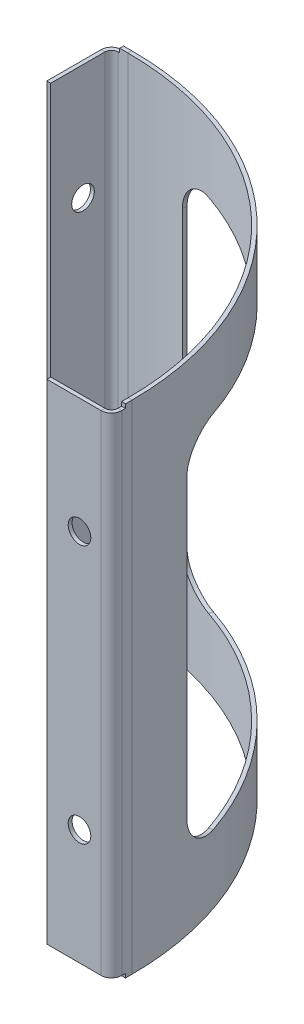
ISO-10303-21;
HEADER;
FILE_DESCRIPTION(('STEP AP214'),'2;1');
FILE_NAME('part.step','',(''),(''),'','','');
FILE_SCHEMA(('AUTOMOTIVE_DESIGN { 1 0 10303 214 1 1 1 1 }'));
ENDSEC;
DATA;
#1=APPLICATION_CONTEXT('core data for automotive mechanical design processes');
#2=APPLICATION_PROTOCOL_DEFINITION('international standard','automotive_design',2000,#1);
#3=PRODUCT_CONTEXT('',#1,'mechanical');
#4=PRODUCT('Part','Part','',(#3));
#5=PRODUCT_RELATED_PRODUCT_CATEGORY('part','',(#4));
#6=PRODUCT_DEFINITION_FORMATION('','',#4);
#7=PRODUCT_DEFINITION_CONTEXT('part definition',#1,'design');
#8=PRODUCT_DEFINITION('design','',#6,#7);
#9=PRODUCT_DEFINITION_SHAPE('','',#8);
#10=(LENGTH_UNIT() NAMED_UNIT(*) SI_UNIT(.MILLI.,.METRE.));
#11=(NAMED_UNIT(*) PLANE_ANGLE_UNIT() SI_UNIT($,.RADIAN.));
#12=(NAMED_UNIT(*) SI_UNIT($,.STERADIAN.) SOLID_ANGLE_UNIT());
#13=UNCERTAINTY_MEASURE_WITH_UNIT(LENGTH_MEASURE(1.E-05),#10,'distance_accuracy_value','');
#14=(GEOMETRIC_REPRESENTATION_CONTEXT(3) GLOBAL_UNCERTAINTY_ASSIGNED_CONTEXT((#13)) GLOBAL_UNIT_ASSIGNED_CONTEXT((#10,
#11,#12)) REPRESENTATION_CONTEXT('',''));
#15=CARTESIAN_POINT('',(0.,0.,0.));
#16=DIRECTION('',(0.,0.,1.));
#17=DIRECTION('',(1.,0.,0.));
#18=AXIS2_PLACEMENT_3D('',#15,#16,#17);
#19=CARTESIAN_POINT('',(5.10553480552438,150.892893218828,73.6999999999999));
#20=DIRECTION('',(0.,1.,0.));
#21=DIRECTION('',(1.,0.,0.));
#22=AXIS2_PLACEMENT_3D('',#19,#20,#21);
#23=CYLINDRICAL_SURFACE('',#22,93.7000000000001);
#24=DIRECTION('',(0.,1.,0.));
#25=VECTOR('',#24,1.);
#26=CARTESIAN_POINT('',(5.10553480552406,0.,-20.));
#27=LINE('',#26,#25);
#28=CARTESIAN_POINT('',(5.10553480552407,150.892893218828,-20.0000000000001));
#29=VERTEX_POINT('',#28);
#30=CARTESIAN_POINT('',(5.10553480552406,-3.10710678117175,-20.));
#31=VERTEX_POINT('',#30);
#32=EDGE_CURVE('E786',#29,#31,#27,.F.);
#33=ORIENTED_EDGE('',*,*,#32,.F.);
#34=CARTESIAN_POINT('',(5.10553480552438,150.892893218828,73.6999999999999));
#35=DIRECTION('',(0.,1.,0.));
#36=DIRECTION('',(0.,0.,1.));
#37=AXIS2_PLACEMENT_3D('',#34,#35,#36);
#38=CIRCLE('',#37,93.7000000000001);
#39=CARTESIAN_POINT('',(98.8055348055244,150.892893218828,73.6999999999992));
#40=VERTEX_POINT('',#39);
#41=EDGE_CURVE('E758',#40,#29,#38,.T.);
#42=ORIENTED_EDGE('',*,*,#41,.F.);
#43=DIRECTION('',(0.,1.,0.));
#44=VECTOR('',#43,1.);
#45=CARTESIAN_POINT('',(98.8055348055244,-3.10710678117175,73.6999999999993));
#46=LINE('',#45,#44);
#47=CARTESIAN_POINT('',(98.8055348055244,-3.10710678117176,73.6999999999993));
#48=VERTEX_POINT('',#47);
#49=EDGE_CURVE('E746',#40,#48,#46,.F.);
#50=ORIENTED_EDGE('',*,*,#49,.T.);
#51=CARTESIAN_POINT('',(5.10553480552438,-3.10710678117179,73.7));
#52=DIRECTION('',(0.,1.,0.));
#53=DIRECTION('',(0.,0.,1.));
#54=AXIS2_PLACEMENT_3D('',#51,#52,#53);
#55=CIRCLE('',#54,93.7000000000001);
#56=EDGE_CURVE('E755',#31,#48,#55,.F.);
#57=ORIENTED_EDGE('',*,*,#56,.F.);
#58=EDGE_LOOP('',(#33,#42,#50,#57));
#59=FACE_BOUND('',#58,.T.);
#60=CARTESIAN_POINT('',(5.10553480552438,18.0928932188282,73.7));
#61=DIRECTION('',(0.,-1.,0.));
#62=DIRECTION('',(1.,0.,0.));
#63=AXIS2_PLACEMENT_3D('',#60,#61,#62);
#64=CIRCLE('',#63,93.7000000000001);
#65=CARTESIAN_POINT('',(93.7884621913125,18.0928932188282,43.4505638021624));
#66=VERTEX_POINT('',#65);
#67=CARTESIAN_POINT('',(35.4237760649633,18.0928932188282,-14.9594284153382));
#68=VERTEX_POINT('',#67);
#69=EDGE_CURVE('E367',#66,#68,#64,.F.);
#70=ORIENTED_EDGE('',*,*,#69,.F.);
#71=CARTESIAN_POINT('',(96.8599759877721,28.0928932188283,54.7049342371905));
#72=CARTESIAN_POINT('',(96.8599763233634,27.9912724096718,54.7049371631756));
#73=CARTESIAN_POINT('',(96.859599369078,27.8896524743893,54.7031151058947));
#74=CARTESIAN_POINT('',(96.8580872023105,27.6865714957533,54.6958121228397));
#75=CARTESIAN_POINT('',(96.8569521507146,27.5851104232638,54.6903319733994));
#76=CARTESIAN_POINT('',(96.8524055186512,27.2812314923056,54.668396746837));
#77=CARTESIAN_POINT('',(96.8478524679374,27.0792223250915,54.6464469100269));
#78=CARTESIAN_POINT('',(96.8296787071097,26.477569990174,54.5590683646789));
#79=CARTESIAN_POINT('',(96.811543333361,26.0809445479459,54.4721087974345));
#80=CARTESIAN_POINT('',(96.7724641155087,25.4476585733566,54.2868800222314));
#81=CARTESIAN_POINT('',(96.7550151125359,25.2058873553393,54.2045741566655));
#82=CARTESIAN_POINT('',(96.7155510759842,24.7303889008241,54.0199626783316));
#83=CARTESIAN_POINT('',(96.6935352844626,24.4966630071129,53.917653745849));
#84=CARTESIAN_POINT('',(96.6450301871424,24.0384504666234,53.6944051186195));
#85=CARTESIAN_POINT('',(96.6185353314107,23.8139757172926,53.573442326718));
#86=CARTESIAN_POINT('',(96.5612051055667,23.3756612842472,53.3145163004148));
#87=CARTESIAN_POINT('',(96.5303697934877,23.1618214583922,53.1765532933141));
#88=CARTESIAN_POINT('',(96.4641641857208,22.7436215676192,52.883814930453));
#89=CARTESIAN_POINT('',(96.4287531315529,22.5393724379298,52.7288906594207));
#90=CARTESIAN_POINT('',(96.3537602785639,22.1432191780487,52.4049537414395));
#91=CARTESIAN_POINT('',(96.3141785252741,21.9513149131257,52.235941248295));
#92=CARTESIAN_POINT('',(96.2309313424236,21.5804517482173,51.8852213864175));
#93=CARTESIAN_POINT('',(96.1872663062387,21.4014916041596,51.7035152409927));
#94=CARTESIAN_POINT('',(96.1187904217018,21.1430963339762,51.4225089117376));
#95=CARTESIAN_POINT('',(96.0954661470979,21.0586304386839,51.3274219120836));
#96=CARTESIAN_POINT('',(96.0478433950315,20.8930356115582,51.1346200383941));
#97=CARTESIAN_POINT('',(96.0235448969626,20.8119067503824,51.0369051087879));
#98=CARTESIAN_POINT('',(95.9408344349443,20.5467914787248,50.7066280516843));
#99=CARTESIAN_POINT('',(95.880258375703,20.3703462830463,50.4684898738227));
#100=CARTESIAN_POINT('',(95.7539853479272,20.03642325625,49.9805581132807));
#101=CARTESIAN_POINT('',(95.6882878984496,19.8789472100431,49.73076343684));
#102=CARTESIAN_POINT('',(95.5860081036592,19.6571336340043,49.3485853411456));
#103=CARTESIAN_POINT('',(95.5512695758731,19.5855554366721,49.2198617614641));
#104=CARTESIAN_POINT('',(95.4805803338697,19.4472387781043,48.9601685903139));
#105=CARTESIAN_POINT('',(95.444629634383,19.3805002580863,48.8291990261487));
#106=CARTESIAN_POINT('',(95.3349835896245,19.187693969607,48.4331928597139));
#107=CARTESIAN_POINT('',(95.2594837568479,19.0690125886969,48.165019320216));
#108=CARTESIAN_POINT('',(95.093087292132,18.8364204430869,47.5842206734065));
#109=CARTESIAN_POINT('',(95.0015106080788,18.7254750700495,47.2706055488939));
#110=CARTESIAN_POINT('',(94.8127455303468,18.5297763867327,46.6368212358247));
#111=CARTESIAN_POINT('',(94.7155557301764,18.4450296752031,46.3166504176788));
#112=CARTESIAN_POINT('',(94.566022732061,18.3381118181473,45.8335415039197));
#113=CARTESIAN_POINT('',(94.5156007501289,18.3058595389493,45.6721762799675));
#114=CARTESIAN_POINT('',(94.4135300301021,18.2480443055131,45.3486200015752));
#115=CARTESIAN_POINT('',(94.3618812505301,18.2224815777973,45.1864289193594));
#116=CARTESIAN_POINT('',(94.2574382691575,18.1781406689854,44.8615321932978));
#117=CARTESIAN_POINT('',(94.2046443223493,18.1593609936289,44.6988266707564));
#118=CARTESIAN_POINT('',(94.0979755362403,18.1286824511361,44.373137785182));
#119=CARTESIAN_POINT('',(94.0441008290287,18.1167827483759,44.2101544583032));
#120=CARTESIAN_POINT('',(93.9565272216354,18.103188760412,43.9476529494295));
#121=CARTESIAN_POINT('',(93.9231418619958,18.0993248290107,43.8481374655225));
#122=CARTESIAN_POINT('',(93.8560474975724,18.0941777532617,43.6492511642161));
#123=CARTESIAN_POINT('',(93.8223388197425,18.0928922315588,43.549880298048));
#124=CARTESIAN_POINT('',(93.7884621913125,18.0928932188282,43.4505638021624));
#125=B_SPLINE_CURVE_WITH_KNOTS('',3,(#71,#72,#73,#74,#75,#76,#77,#78,#79,#80,#81,#82,#83,#84,
#85,#86,#87,#88,#89,#90,#91,#92,#93,#94,#95,#96,#97,#98,#99,#100,#101,#102,#103,#104,#105,#106,
#107,#108,#109,#110,#111,#112,#113,#114,#115,#116,#117,#118,#119,#120,#121,#122,#123,#124),
.UNSPECIFIED.,.F.,.F.,(4,2,2,2,2,2,2,2,2,2,2,2,2,2,2,2,2,2,2,2,2,2,2,2,2,2,4),(0.,
0.304843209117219,0.609621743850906,1.21889280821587,2.43340147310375,3.20056823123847,
3.96786241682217,4.73611440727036,5.50435612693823,6.27998552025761,7.05560644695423,
7.8311527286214,8.21900688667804,8.60686925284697,9.51343385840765,10.4200837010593,
10.8739791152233,11.327869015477,12.2355086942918,13.269532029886,14.30381559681,
14.8200288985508,15.3362596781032,15.8523766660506,16.3684309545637,16.6835135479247,
16.9983054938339),.UNSPECIFIED.);
#126=CARTESIAN_POINT('',(96.8599759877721,28.0928932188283,54.7049342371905));
#127=VERTEX_POINT('',#126);
#128=EDGE_CURVE('E416',#127,#66,#125,.T.);
#129=ORIENTED_EDGE('',*,*,#128,.F.);
#130=DIRECTION('',(0.,1.,0.));
#131=VECTOR('',#130,1.);
#132=CARTESIAN_POINT('',(96.8599759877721,150.892893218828,54.7049342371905));
#133=LINE('',#132,#131);
#134=CARTESIAN_POINT('',(96.8599759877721,119.692893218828,54.7049342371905));
#135=VERTEX_POINT('',#134);
#136=EDGE_CURVE('E420',#135,#127,#133,.F.);
#137=ORIENTED_EDGE('',*,*,#136,.F.);
#138=CARTESIAN_POINT('',(93.7884621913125,129.692893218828,43.4505638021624));
#139=CARTESIAN_POINT('',(93.8533754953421,129.692907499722,43.6408651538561));
#140=CARTESIAN_POINT('',(93.9176722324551,129.688177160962,43.8313761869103));
#141=CARTESIAN_POINT('',(94.044881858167,129.669278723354,44.2123287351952));
#142=CARTESIAN_POINT('',(94.1077951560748,129.655113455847,44.4027702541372));
#143=CARTESIAN_POINT('',(94.2322308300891,129.617364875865,44.7835294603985));
#144=CARTESIAN_POINT('',(94.293750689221,129.593765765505,44.9738464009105));
#145=CARTESIAN_POINT('',(94.4151951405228,129.537334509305,45.3536717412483));
#146=CARTESIAN_POINT('',(94.4751193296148,129.504500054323,45.543179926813));
#147=CARTESIAN_POINT('',(94.5872891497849,129.433484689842,45.9018472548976));
#148=CARTESIAN_POINT('',(94.6396991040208,129.396178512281,46.0711287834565));
#149=CARTESIAN_POINT('',(94.7430681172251,129.314180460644,46.4083579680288));
#150=CARTESIAN_POINT('',(94.7940270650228,129.269488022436,46.5763055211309));
#151=CARTESIAN_POINT('',(94.8944421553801,129.172776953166,46.9105881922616));
#152=CARTESIAN_POINT('',(94.9438978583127,129.120756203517,47.0769228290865));
#153=CARTESIAN_POINT('',(95.0412421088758,129.00954277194,47.4076387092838));
#154=CARTESIAN_POINT('',(95.0891306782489,128.950350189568,47.572019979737));
#155=CARTESIAN_POINT('',(95.1833622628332,128.824740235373,47.898760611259));
#156=CARTESIAN_POINT('',(95.2297027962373,128.758311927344,48.0611164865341));
#157=CARTESIAN_POINT('',(95.3207079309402,128.618308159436,48.3831964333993));
#158=CARTESIAN_POINT('',(95.3653725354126,128.544732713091,48.5429205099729));
#159=CARTESIAN_POINT('',(95.4529778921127,128.390509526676,48.8593783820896));
#160=CARTESIAN_POINT('',(95.4959188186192,128.309862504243,49.0161124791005));
#161=CARTESIAN_POINT('',(95.580052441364,128.141632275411,49.3262953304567));
#162=CARTESIAN_POINT('',(95.6212451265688,128.054049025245,49.4797440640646));
#163=CARTESIAN_POINT('',(95.7015462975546,127.872650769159,49.78186976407));
#164=CARTESIAN_POINT('',(95.7406678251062,127.778886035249,49.9305734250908));
#165=CARTESIAN_POINT('',(95.8171002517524,127.584559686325,50.2239510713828));
#166=CARTESIAN_POINT('',(95.8544111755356,127.483998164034,50.3686251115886));
#167=CARTESIAN_POINT('',(95.9271935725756,127.276154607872,50.6535701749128));
#168=CARTESIAN_POINT('',(95.962664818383,127.168871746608,50.7938406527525));
#169=CARTESIAN_POINT('',(96.0317460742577,126.947768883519,51.0696154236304));
#170=CARTESIAN_POINT('',(96.0653560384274,126.833948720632,51.2051195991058));
#171=CARTESIAN_POINT('',(96.130619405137,126.600000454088,51.4706805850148));
#172=CARTESIAN_POINT('',(96.1622757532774,126.479882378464,51.600745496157));
#173=CARTESIAN_POINT('',(96.223642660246,126.233267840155,51.8551483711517));
#174=CARTESIAN_POINT('',(96.2533533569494,126.106771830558,51.97948674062));
#175=CARTESIAN_POINT('',(96.3107842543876,125.84760692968,52.2219184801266));
#176=CARTESIAN_POINT('',(96.3385053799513,125.714940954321,52.3400147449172));
#177=CARTESIAN_POINT('',(96.3919536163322,125.443575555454,52.5696040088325));
#178=CARTESIAN_POINT('',(96.417680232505,125.304874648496,52.6810953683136));
#179=CARTESIAN_POINT('',(96.4782263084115,124.957727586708,52.9455537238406));
#180=CARTESIAN_POINT('',(96.5119145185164,124.74603549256,53.0945516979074));
#181=CARTESIAN_POINT('',(96.5748521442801,124.311175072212,53.3757594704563));
#182=CARTESIAN_POINT('',(96.6041025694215,124.088009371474,53.5079730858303));
#183=CARTESIAN_POINT('',(96.6445334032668,123.74567173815,53.6923592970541));
#184=CARTESIAN_POINT('',(96.6574274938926,123.630387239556,53.751458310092));
#185=CARTESIAN_POINT('',(96.6820696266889,123.397391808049,53.864888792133));
#186=CARTESIAN_POINT('',(96.6938178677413,123.279681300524,53.9192210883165));
#187=CARTESIAN_POINT('',(96.7161445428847,123.041962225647,54.0228813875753));
#188=CARTESIAN_POINT('',(96.7267229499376,122.921953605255,54.0722092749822));
#189=CARTESIAN_POINT('',(96.7466922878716,122.679832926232,54.165657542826));
#190=CARTESIAN_POINT('',(96.756083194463,122.557720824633,54.2097778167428));
#191=CARTESIAN_POINT('',(96.7805605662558,122.215137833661,54.3251351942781));
#192=CARTESIAN_POINT('',(96.7943441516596,121.992569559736,54.3905316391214));
#193=CARTESIAN_POINT('',(96.8180455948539,121.542791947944,54.5034198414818));
#194=CARTESIAN_POINT('',(96.8279639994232,121.315583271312,54.550914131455));
#195=CARTESIAN_POINT('',(96.8439219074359,120.856678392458,54.6275097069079));
#196=CARTESIAN_POINT('',(96.8499408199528,120.624964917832,54.6565133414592));
#197=CARTESIAN_POINT('',(96.8559617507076,120.276146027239,54.6855518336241));
#198=CARTESIAN_POINT('',(96.857467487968,120.159626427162,54.6928201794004));
#199=CARTESIAN_POINT('',(96.8594748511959,119.926373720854,54.7025133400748));
#200=CARTESIAN_POINT('',(96.8599764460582,119.80964060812,54.7049380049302));
#201=CARTESIAN_POINT('',(96.8599759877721,119.692893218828,54.7049342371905));
#202=B_SPLINE_CURVE_WITH_KNOTS('',3,(#138,#139,#140,#141,#142,#143,#144,#145,#146,#147,#148,
#149,#150,#151,#152,#153,#154,#155,#156,#157,#158,#159,#160,#161,#162,#163,#164,#165,#166,#167,
#168,#169,#170,#171,#172,#173,#174,#175,#176,#177,#178,#179,#180,#181,#182,#183,#184,#185,#186,
#187,#188,#189,#190,#191,#192,#193,#194,#195,#196,#197,#198,#199,#200,#201),.UNSPECIFIED.,.F.,
.F.,(4,2,2,2,2,2,2,2,2,2,2,2,2,2,2,2,2,2,2,2,2,2,2,2,2,2,2,2,2,2,2,4),(0.,0.603146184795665,
1.20611145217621,1.81009070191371,2.41422110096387,2.95734463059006,3.50050966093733,
4.04383204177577,4.58714688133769,5.13129460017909,5.6754412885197,6.21953281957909,
6.76362778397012,7.30374267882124,7.84385020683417,8.38402435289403,8.92421181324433,
9.46356382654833,10.0028775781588,10.5419389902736,11.0811336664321,11.8634784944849,
12.6456450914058,13.0361195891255,13.426526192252,13.8169418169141,14.2073654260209,
14.9037090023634,15.5999540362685,16.2998461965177,16.6500226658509,17.0002099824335),.UNSPECIFIED.);
#203=CARTESIAN_POINT('',(93.7884621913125,129.692893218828,43.4505638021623));
#204=VERTEX_POINT('',#203);
#205=EDGE_CURVE('E351',#204,#135,#202,.T.);
#206=ORIENTED_EDGE('',*,*,#205,.F.);
#207=CARTESIAN_POINT('',(5.10553480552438,129.692893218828,73.6999999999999));
#208=DIRECTION('',(0.,1.,0.));
#209=DIRECTION('',(0.,0.,1.));
#210=AXIS2_PLACEMENT_3D('',#207,#208,#209);
#211=CIRCLE('',#210,93.7000000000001);
#212=CARTESIAN_POINT('',(35.4237760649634,129.692893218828,-14.9594284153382));
#213=VERTEX_POINT('',#212);
#214=EDGE_CURVE('E356',#213,#204,#211,.F.);
#215=ORIENTED_EDGE('',*,*,#214,.F.);
#216=CARTESIAN_POINT('',(24.1775138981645,119.692893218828,-18.0384849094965));
#217=CARTESIAN_POINT('',(24.1775109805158,119.794511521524,-18.0384852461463));
#218=CARTESIAN_POINT('',(24.179331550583,119.896128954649,-18.0381070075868));
#219=CARTESIAN_POINT('',(24.1866285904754,120.099205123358,-18.0365896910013));
#220=CARTESIAN_POINT('',(24.1921042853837,120.200663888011,-18.0354507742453));
#221=CARTESIAN_POINT('',(24.2140217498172,120.50453661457,-18.0308886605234));
#222=CARTESIAN_POINT('',(24.2359538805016,120.706542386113,-18.0263201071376));
#223=CARTESIAN_POINT('',(24.3232634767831,121.308194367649,-18.0080843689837));
#224=CARTESIAN_POINT('',(24.4101559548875,121.704826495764,-17.9898870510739));
#225=CARTESIAN_POINT('',(24.5952695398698,122.338203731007,-17.9506704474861));
#226=CARTESIAN_POINT('',(24.6775422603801,122.580052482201,-17.933156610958));
#227=CARTESIAN_POINT('',(24.8620888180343,123.055708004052,-17.8935451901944));
#228=CARTESIAN_POINT('',(24.9643659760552,123.289513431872,-17.8714468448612));
#229=CARTESIAN_POINT('',(25.1875539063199,123.747884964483,-17.8227597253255));
#230=CARTESIAN_POINT('',(25.3084877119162,123.972439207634,-17.7961653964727));
#231=CARTESIAN_POINT('',(25.5673608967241,124.410911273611,-17.738620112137));
#232=CARTESIAN_POINT('',(25.705300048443,124.624829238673,-17.7076692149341));
#233=CARTESIAN_POINT('',(25.9979948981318,125.043180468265,-17.6412165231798));
#234=CARTESIAN_POINT('',(26.1528993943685,125.24750289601,-17.6056738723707));
#235=CARTESIAN_POINT('',(26.4768033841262,125.643797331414,-17.5304035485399));
#236=CARTESIAN_POINT('',(26.6458027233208,125.835769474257,-17.4906759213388));
#237=CARTESIAN_POINT('',(26.9965042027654,126.206759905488,-17.4071233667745));
#238=CARTESIAN_POINT('',(27.1782051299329,126.385779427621,-17.3632988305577));
#239=CARTESIAN_POINT('',(27.4592081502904,126.64425672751,-17.2945745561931));
#240=CARTESIAN_POINT('',(27.5542948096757,126.728748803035,-17.271165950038));
#241=CARTESIAN_POINT('',(27.7470975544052,126.894393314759,-17.223371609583));
#242=CARTESIAN_POINT('',(27.8448136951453,126.975545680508,-17.1989858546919));
#243=CARTESIAN_POINT('',(28.1749939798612,127.240651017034,-17.1160054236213));
#244=CARTESIAN_POINT('',(28.4130317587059,127.417064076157,-17.0552426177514));
#245=CARTESIAN_POINT('',(28.9007604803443,127.750919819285,-16.9285866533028));
#246=CARTESIAN_POINT('',(29.1504525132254,127.908360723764,-16.8626930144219));
#247=CARTESIAN_POINT('',(29.5324745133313,128.130118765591,-16.7601130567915));
#248=CARTESIAN_POINT('',(29.6611456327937,128.201677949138,-16.7252734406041));
#249=CARTESIAN_POINT('',(29.9207335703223,128.339954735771,-16.6543801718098));
#250=CARTESIAN_POINT('',(30.051650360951,128.406672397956,-16.6183265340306));
#251=CARTESIAN_POINT('',(30.4474974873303,128.599413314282,-16.5083691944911));
#252=CARTESIAN_POINT('',(30.715564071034,128.718047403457,-16.4326584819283));
#253=CARTESIAN_POINT('',(31.2960055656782,128.95047982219,-16.2658416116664));
#254=CARTESIAN_POINT('',(31.6093665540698,129.06132204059,-16.1740570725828));
#255=CARTESIAN_POINT('',(32.2426333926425,129.256823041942,-15.9848764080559));
#256=CARTESIAN_POINT('',(32.5625408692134,129.341475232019,-15.8874788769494));
#257=CARTESIAN_POINT('',(33.0452483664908,129.448256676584,-15.7376362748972));
#258=CARTESIAN_POINT('',(33.2064785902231,129.480464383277,-15.6871115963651));
#259=CARTESIAN_POINT('',(33.5297628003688,129.538192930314,-15.5848362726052));
#260=CARTESIAN_POINT('',(33.6918168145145,129.563713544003,-15.5330855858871));
#261=CARTESIAN_POINT('',(34.0164374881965,129.607971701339,-15.4284398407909));
#262=CARTESIAN_POINT('',(34.1790040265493,129.626710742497,-15.3755450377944));
#263=CARTESIAN_POINT('',(34.5044130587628,129.657310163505,-15.2686758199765));
#264=CARTESIAN_POINT('',(34.667255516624,129.669171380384,-15.2147015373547));
#265=CARTESIAN_POINT('',(34.9291270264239,129.682684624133,-15.127103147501));
#266=CARTESIAN_POINT('',(35.0281539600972,129.686515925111,-15.0937935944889));
#267=CARTESIAN_POINT('',(35.2260639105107,129.691619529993,-15.026854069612));
#268=CARTESIAN_POINT('',(35.3249469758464,129.692894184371,-14.993224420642));
#269=CARTESIAN_POINT('',(35.4237760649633,129.692893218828,-14.9594284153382));
#270=B_SPLINE_CURVE_WITH_KNOTS('',3,(#216,#217,#218,#219,#220,#221,#222,#223,#224,#225,#226,
#227,#228,#229,#230,#231,#232,#233,#234,#235,#236,#237,#238,#239,#240,#241,#242,#243,#244,#245,
#246,#247,#248,#249,#250,#251,#252,#253,#254,#255,#256,#257,#258,#259,#260,#261,#262,#263,#264,
#265,#266,#267,#268,#269),.UNSPECIFIED.,.F.,.F.,(4,2,2,2,2,2,2,2,2,2,2,2,2,2,2,2,2,2,2,2,2,2,2,
2,2,2,4),(0.,0.304835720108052,0.609606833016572,1.21886370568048,2.43336233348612,
3.20072990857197,3.96822498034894,4.73667529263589,5.50511532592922,6.28093628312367,
7.05674874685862,7.83248721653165,8.2204375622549,8.60839608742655,9.51477940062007,
10.4212476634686,10.8750519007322,11.3288505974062,12.2363077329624,13.2697047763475,
14.3033617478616,14.819260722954,15.3351771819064,15.8509796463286,16.3667193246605,
16.6803379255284,16.9936680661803),.UNSPECIFIED.);
#271=CARTESIAN_POINT('',(24.1775138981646,119.692893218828,-18.0384849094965));
#272=VERTEX_POINT('',#271);
#273=EDGE_CURVE('E345',#272,#213,#270,.T.);
#274=ORIENTED_EDGE('',*,*,#273,.F.);
#275=DIRECTION('',(0.,1.,0.));
#276=VECTOR('',#275,1.);
#277=CARTESIAN_POINT('',(24.1775138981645,150.892893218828,-18.0384849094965));
#278=LINE('',#277,#276);
#279=CARTESIAN_POINT('',(24.1775138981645,28.0928932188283,-18.0384849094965));
#280=VERTEX_POINT('',#279);
#281=EDGE_CURVE('E350',#280,#272,#278,.T.);
#282=ORIENTED_EDGE('',*,*,#281,.F.);
#283=CARTESIAN_POINT('',(35.4237760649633,18.0928932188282,-14.9594284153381));
#284=CARTESIAN_POINT('',(35.2335231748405,18.092878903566,-15.0244900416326));
#285=CARTESIAN_POINT('',(35.0430601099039,18.0976132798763,-15.0889352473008));
#286=CARTESIAN_POINT('',(34.6622032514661,18.1165279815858,-15.2164414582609));
#287=CARTESIAN_POINT('',(34.4718094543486,18.1307054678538,-15.2795028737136));
#288=CARTESIAN_POINT('',(34.0911460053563,18.1684867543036,-15.4042342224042));
#289=CARTESIAN_POINT('',(33.9008771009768,18.1921063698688,-15.4659016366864));
#290=CARTESIAN_POINT('',(33.5211487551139,18.2485866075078,-15.5876398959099));
#291=CARTESIAN_POINT('',(33.3316895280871,18.2814495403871,-15.6477103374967));
#292=CARTESIAN_POINT('',(32.9732625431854,18.3524977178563,-15.7601103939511));
#293=CARTESIAN_POINT('',(32.8041713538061,18.3898011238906,-15.8126057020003));
#294=CARTESIAN_POINT('',(32.4673220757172,18.4717873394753,-15.9161461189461));
#295=CARTESIAN_POINT('',(32.2995640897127,18.5164707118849,-15.9671911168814));
#296=CARTESIAN_POINT('',(31.965659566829,18.6131573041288,-16.067778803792));
#297=CARTESIAN_POINT('',(31.7995135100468,18.665162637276,-16.1173210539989));
#298=CARTESIAN_POINT('',(31.4691733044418,18.7763388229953,-16.2148387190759));
#299=CARTESIAN_POINT('',(31.3049791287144,18.8355095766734,-16.2628141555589));
#300=CARTESIAN_POINT('',(30.9786117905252,18.9610684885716,-16.3572195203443));
#301=CARTESIAN_POINT('',(30.8164420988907,19.0274675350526,-16.4036469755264));
#302=CARTESIAN_POINT('',(30.494732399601,19.1674064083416,-16.4948257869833));
#303=CARTESIAN_POINT('',(30.3351923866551,19.2409462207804,-16.5395771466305));
#304=CARTESIAN_POINT('',(30.0190999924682,19.3950914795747,-16.6273556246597));
#305=CARTESIAN_POINT('',(29.8625473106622,19.4756962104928,-16.6703829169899));
#306=CARTESIAN_POINT('',(29.5527237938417,19.6438342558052,-16.7546887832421));
#307=CARTESIAN_POINT('',(29.3994529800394,19.7313676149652,-16.795967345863));
#308=CARTESIAN_POINT('',(29.0976743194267,19.9126604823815,-16.8764398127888));
#309=CARTESIAN_POINT('',(28.9491398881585,20.0063699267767,-16.9156467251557));
#310=CARTESIAN_POINT('',(28.6560960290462,20.2005778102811,-16.9922488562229));
#311=CARTESIAN_POINT('',(28.5115865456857,20.3010761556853,-17.0296440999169));
#312=CARTESIAN_POINT('',(28.2269655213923,20.5087855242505,-17.1025937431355));
#313=CARTESIAN_POINT('',(28.0868545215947,20.6159973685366,-17.1381479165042));
#314=CARTESIAN_POINT('',(27.8113921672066,20.8369495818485,-17.20739357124));
#315=CARTESIAN_POINT('',(27.6760409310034,20.950690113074,-17.2410850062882));
#316=CARTESIAN_POINT('',(27.4107759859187,21.1844702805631,-17.3065099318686));
#317=CARTESIAN_POINT('',(27.280854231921,21.3044999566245,-17.3382463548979));
#318=CARTESIAN_POINT('',(27.0267297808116,21.5509296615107,-17.3997711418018));
#319=CARTESIAN_POINT('',(26.9025266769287,21.677329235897,-17.4295596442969));
#320=CARTESIAN_POINT('',(26.6603557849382,21.9362929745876,-17.4871437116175));
#321=CARTESIAN_POINT('',(26.5423851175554,22.0688542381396,-17.5149401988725));
#322=CARTESIAN_POINT('',(26.313033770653,22.3399995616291,-17.5685370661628));
#323=CARTESIAN_POINT('',(26.2016547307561,22.4785851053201,-17.5943369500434));
#324=CARTESIAN_POINT('',(25.9372685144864,22.8256825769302,-17.6551021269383));
#325=CARTESIAN_POINT('',(25.788240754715,23.0374500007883,-17.6889295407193));
#326=CARTESIAN_POINT('',(25.5069788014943,23.4724675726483,-17.7521288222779));
#327=CARTESIAN_POINT('',(25.3747407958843,23.6957150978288,-17.7815017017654));
#328=CARTESIAN_POINT('',(25.1903222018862,24.0381800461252,-17.8221026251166));
#329=CARTESIAN_POINT('',(25.1312129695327,24.1535080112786,-17.835051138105));
#330=CARTESIAN_POINT('',(25.0177630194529,24.3865912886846,-17.8597975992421));
#331=CARTESIAN_POINT('',(24.9634214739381,24.5043461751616,-17.8715957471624));
#332=CARTESIAN_POINT('',(24.8597434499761,24.7421547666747,-17.8940175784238));
#333=CARTESIAN_POINT('',(24.8104070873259,24.8622085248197,-17.9046412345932));
#334=CARTESIAN_POINT('',(24.7169426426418,25.1044201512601,-17.9246962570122));
#335=CARTESIAN_POINT('',(24.6728146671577,25.2265780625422,-17.9341275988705));
#336=CARTESIAN_POINT('',(24.5574253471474,25.5693239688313,-17.9587131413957));
#337=CARTESIAN_POINT('',(24.4920082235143,25.7920109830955,-17.9725584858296));
#338=CARTESIAN_POINT('',(24.3790854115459,26.2420284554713,-17.9963662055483));
#339=CARTESIAN_POINT('',(24.3315771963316,26.4693582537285,-18.0063291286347));
#340=CARTESIAN_POINT('',(24.2549597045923,26.928504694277,-18.022358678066));
#341=CARTESIAN_POINT('',(24.225947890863,27.1603385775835,-18.0284046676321));
#342=CARTESIAN_POINT('',(24.196901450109,27.5093384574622,-18.03445265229));
#343=CARTESIAN_POINT('',(24.1896311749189,27.6259183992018,-18.0359651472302));
#344=CARTESIAN_POINT('',(24.1799354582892,27.8592918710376,-18.0379815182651));
#345=CARTESIAN_POINT('',(24.1775101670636,27.9760854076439,-18.0384853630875));
#346=CARTESIAN_POINT('',(24.1775138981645,28.0928932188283,-18.0384849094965));
#347=B_SPLINE_CURVE_WITH_KNOTS('',3,(#283,#284,#285,#286,#287,#288,#289,#290,#291,#292,#293,
#294,#295,#296,#297,#298,#299,#300,#301,#302,#303,#304,#305,#306,#307,#308,#309,#310,#311,#312,
#313,#314,#315,#316,#317,#318,#319,#320,#321,#322,#323,#324,#325,#326,#327,#328,#329,#330,#331,
#332,#333,#334,#335,#336,#337,#338,#339,#340,#341,#342,#343,#344,#345,#346),.UNSPECIFIED.,.F.,
.F.,(4,2,2,2,2,2,2,2,2,2,2,2,2,2,2,2,2,2,2,2,2,2,2,2,2,2,2,2,2,2,2,4),(0.,0.603152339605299,
1.20612341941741,1.81010872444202,2.41424515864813,2.95690762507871,3.49961149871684,
4.04247233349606,4.58532567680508,5.12900836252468,5.67268995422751,6.21631655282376,
6.75994666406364,7.29961201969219,7.83926992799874,8.37899397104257,8.91873142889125,
9.45763851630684,9.99650721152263,10.5351247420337,11.0738756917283,11.8565078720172,
12.6389620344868,13.0295820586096,13.4201341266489,13.8106952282,14.2012643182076,
14.8979769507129,15.5945912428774,16.2948465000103,16.6452042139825,16.9955727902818),.UNSPECIFIED.);
#348=EDGE_CURVE('E421',#68,#280,#347,.T.);
#349=ORIENTED_EDGE('',*,*,#348,.F.);
#350=EDGE_LOOP('',(#70,#129,#137,#206,#215,#274,#282,#349));
#351=FACE_BOUND('',#350,.T.);
#352=ADVANCED_FACE('F137',(#59,#351),#23,.T.);
#353=CARTESIAN_POINT('',(5.10553480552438,150.892893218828,73.6999999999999));
#354=DIRECTION('',(0.,1.,0.));
#355=DIRECTION('',(1.,0.,0.));
#356=AXIS2_PLACEMENT_3D('',#353,#354,#355);
#357=CYLINDRICAL_SURFACE('',#356,92.5000000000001);
#358=DIRECTION('',(0.,-1.,0.));
#359=VECTOR('',#358,1.);
#360=CARTESIAN_POINT('',(5.10553480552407,-3.10710678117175,-18.8));
#361=LINE('',#360,#359);
#362=CARTESIAN_POINT('',(5.10553480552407,150.892893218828,-18.8000000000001));
#363=VERTEX_POINT('',#362);
#364=CARTESIAN_POINT('',(5.10553480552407,-3.10710678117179,-18.8000000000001));
#365=VERTEX_POINT('',#364);
#366=EDGE_CURVE('E803',#363,#365,#361,.T.);
#367=ORIENTED_EDGE('',*,*,#366,.T.);
#368=CARTESIAN_POINT('',(5.10553480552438,-3.10710678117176,73.7));
#369=DIRECTION('',(0.,1.,0.));
#370=DIRECTION('',(0.,0.,1.));
#371=AXIS2_PLACEMENT_3D('',#368,#369,#370);
#372=CIRCLE('',#371,92.5000000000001);
#373=CARTESIAN_POINT('',(97.6055348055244,-3.10710678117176,73.6999999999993));
#374=VERTEX_POINT('',#373);
#375=EDGE_CURVE('E761',#365,#374,#372,.F.);
#376=ORIENTED_EDGE('',*,*,#375,.T.);
#377=DIRECTION('',(0.,1.,0.));
#378=VECTOR('',#377,1.);
#379=CARTESIAN_POINT('',(97.6055348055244,-3.10710678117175,73.6999999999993));
#380=LINE('',#379,#378);
#381=CARTESIAN_POINT('',(97.6055348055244,150.892893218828,73.6999999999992));
#382=VERTEX_POINT('',#381);
#383=EDGE_CURVE('E751',#374,#382,#380,.T.);
#384=ORIENTED_EDGE('',*,*,#383,.T.);
#385=CARTESIAN_POINT('',(5.10553480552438,150.892893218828,73.6999999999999));
#386=DIRECTION('',(0.,1.,0.));
#387=DIRECTION('',(0.,0.,1.));
#388=AXIS2_PLACEMENT_3D('',#385,#386,#387);
#389=CIRCLE('',#388,92.5000000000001);
#390=EDGE_CURVE('E709',#382,#363,#389,.T.);
#391=ORIENTED_EDGE('',*,*,#390,.T.);
#392=EDGE_LOOP('',(#367,#376,#384,#391));
#393=FACE_BOUND('',#392,.T.);
#394=CARTESIAN_POINT('',(95.6848924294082,28.0928932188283,54.9482008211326));
#395=CARTESIAN_POINT('',(95.6848927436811,27.9902737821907,54.9482036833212));
#396=CARTESIAN_POINT('',(95.6845132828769,27.8876551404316,54.946369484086));
#397=CARTESIAN_POINT('',(95.6829909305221,27.6825774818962,54.9390173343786));
#398=CARTESIAN_POINT('',(95.6818482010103,27.5801184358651,54.9335001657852));
#399=CARTESIAN_POINT('',(95.6772704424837,27.2732455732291,54.9114153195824));
#400=CARTESIAN_POINT('',(95.6726858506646,27.0692422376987,54.8893143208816));
#401=CARTESIAN_POINT('',(95.6543820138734,26.4615589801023,54.801318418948));
#402=CARTESIAN_POINT('',(95.6361126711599,26.0609088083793,54.7137289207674));
#403=CARTESIAN_POINT('',(95.5967436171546,25.4216358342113,54.5271978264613));
#404=CARTESIAN_POINT('',(95.5791850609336,25.1778531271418,54.4444141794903));
#405=CARTESIAN_POINT('',(95.5394604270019,24.6983725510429,54.2586997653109));
#406=CARTESIAN_POINT('',(95.5172936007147,24.4626760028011,54.1557657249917));
#407=CARTESIAN_POINT('',(95.4684364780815,24.000600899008,53.9311050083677));
#408=CARTESIAN_POINT('',(95.4417408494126,23.7742337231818,53.8093561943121));
#409=CARTESIAN_POINT('',(95.3839451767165,23.3322410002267,53.5486616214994));
#410=CARTESIAN_POINT('',(95.3528451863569,23.1166153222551,53.4097160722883));
#411=CARTESIAN_POINT('',(95.2860562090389,22.6951006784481,53.1148937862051));
#412=CARTESIAN_POINT('',(95.2503284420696,22.4893168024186,52.9588759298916));
#413=CARTESIAN_POINT('',(95.1746236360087,22.0902642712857,52.6325535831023));
#414=CARTESIAN_POINT('',(95.1346466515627,21.8969954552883,52.4622492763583));
#415=CARTESIAN_POINT('',(95.0505190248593,21.5236777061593,52.1087331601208));
#416=CARTESIAN_POINT('',(95.0063688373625,21.3436273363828,51.9255227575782));
#417=CARTESIAN_POINT('',(94.9140029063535,20.9970940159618,51.5476434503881));
#418=CARTESIAN_POINT('',(94.865786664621,20.8306127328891,51.3529731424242));
#419=CARTESIAN_POINT('',(94.7574613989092,20.4862836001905,50.9219642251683));
#420=CARTESIAN_POINT('',(94.6966772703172,20.3107993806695,50.6839034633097));
#421=CARTESIAN_POINT('',(94.5699398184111,19.9789954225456,50.1960909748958));
#422=CARTESIAN_POINT('',(94.5039860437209,19.8226773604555,49.9463382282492));
#423=CARTESIAN_POINT('',(94.3670193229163,19.5293142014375,49.4367131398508));
#424=CARTESIAN_POINT('',(94.2960008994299,19.3922904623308,49.1768299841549));
#425=CARTESIAN_POINT('',(94.1491303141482,19.138266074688,48.6487886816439));
#426=CARTESIAN_POINT('',(94.0732781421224,19.0212654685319,48.3806305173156));
#427=CARTESIAN_POINT('',(93.9070581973,18.793956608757,47.8032676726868));
#428=CARTESIAN_POINT('',(93.8160689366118,18.6863744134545,47.4931670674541));
#429=CARTESIAN_POINT('',(93.6285570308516,18.4973775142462,46.866598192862));
#430=CARTESIAN_POINT('',(93.5320329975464,18.415969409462,46.5501283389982));
#431=CARTESIAN_POINT('',(93.3835648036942,18.314053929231,46.072709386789));
#432=CARTESIAN_POINT('',(93.3335083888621,18.2834666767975,45.913262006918));
#433=CARTESIAN_POINT('',(93.2321929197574,18.2289751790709,45.5935910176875));
#434=CARTESIAN_POINT('',(93.180933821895,18.2050711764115,45.433367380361));
#435=CARTESIAN_POINT('',(93.0773149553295,18.1640845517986,45.1125148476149));
#436=CARTESIAN_POINT('',(93.0249558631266,18.1469978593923,44.95188625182));
#437=CARTESIAN_POINT('',(92.9191864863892,18.1197101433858,44.6304075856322));
#438=CARTESIAN_POINT('',(92.8657763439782,18.1095081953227,44.4695575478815));
#439=CARTESIAN_POINT('',(92.7855692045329,18.0994712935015,44.2302115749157));
#440=CARTESIAN_POINT('',(92.7591400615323,18.0970027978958,44.1516946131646));
#441=CARTESIAN_POINT('',(92.7060808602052,18.0937142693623,43.9947616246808));
#442=CARTESIAN_POINT('',(92.6794509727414,18.0928929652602,43.9163455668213));
#443=CARTESIAN_POINT('',(92.6527149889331,18.0928932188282,43.8379631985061));
#444=B_SPLINE_CURVE_WITH_KNOTS('',3,(#394,#395,#396,#397,#398,#399,#400,#401,#402,#403,#404,
#405,#406,#407,#408,#409,#410,#411,#412,#413,#414,#415,#416,#417,#418,#419,#420,#421,#422,#423,
#424,#425,#426,#427,#428,#429,#430,#431,#432,#433,#434,#435,#436,#437,#438,#439,#440,#441,#442,
#443),.UNSPECIFIED.,.F.,.F.,(4,2,2,2,2,2,2,2,2,2,2,2,2,2,2,2,2,2,2,2,2,2,2,2,4),(0.,
0.307839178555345,0.615613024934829,1.23088009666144,2.45756013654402,3.23090559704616,
4.00437677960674,4.77876506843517,5.55314392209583,6.33449182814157,7.11582968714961,
7.89708250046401,8.67843118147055,9.58329940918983,10.4882467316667,11.3941880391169,
12.3001312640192,13.3208559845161,14.3418378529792,14.8514129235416,15.3610064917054,
15.870295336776,16.3795157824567,16.6281489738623,16.8765902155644),.UNSPECIFIED.);
#445=CARTESIAN_POINT('',(95.6848924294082,28.0928932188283,54.9482008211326));
#446=VERTEX_POINT('',#445);
#447=CARTESIAN_POINT('',(92.6527149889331,18.0928932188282,43.8379631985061));
#448=VERTEX_POINT('',#447);
#449=EDGE_CURVE('E443',#446,#448,#444,.T.);
#450=ORIENTED_EDGE('',*,*,#449,.T.);
#451=CARTESIAN_POINT('',(5.10553480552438,18.0928932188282,73.7));
#452=DIRECTION('',(0.,1.,0.));
#453=DIRECTION('',(0.,0.,1.));
#454=AXIS2_PLACEMENT_3D('',#451,#452,#453);
#455=CIRCLE('',#454,92.5000000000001);
#456=CARTESIAN_POINT('',(35.0354954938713,18.0928932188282,-13.8239821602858));
#457=VERTEX_POINT('',#456);
#458=EDGE_CURVE('E366',#448,#457,#455,.T.);
#459=ORIENTED_EDGE('',*,*,#458,.T.);
#460=CARTESIAN_POINT('',(35.0354954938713,18.0928932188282,-13.8239821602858));
#461=CARTESIAN_POINT('',(34.8432446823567,18.0928771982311,-13.8897272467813));
#462=CARTESIAN_POINT('',(34.6507765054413,18.0978388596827,-13.9548343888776));
#463=CARTESIAN_POINT('',(34.2659381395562,18.1176566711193,-14.0836084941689));
#464=CARTESIAN_POINT('',(34.0735679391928,18.1325095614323,-14.1472759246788));
#465=CARTESIAN_POINT('',(33.6890210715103,18.1720809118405,-14.2731512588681));
#466=CARTESIAN_POINT('',(33.4968452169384,18.1968152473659,-14.3353566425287));
#467=CARTESIAN_POINT('',(33.1133937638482,18.2559369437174,-14.4580986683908));
#468=CARTESIAN_POINT('',(32.9221184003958,18.2903266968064,-14.518634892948));
#469=CARTESIAN_POINT('',(32.565981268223,18.3635170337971,-14.6300853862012));
#470=CARTESIAN_POINT('',(32.400946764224,18.4011468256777,-14.6812199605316));
#471=CARTESIAN_POINT('',(32.0722337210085,18.4836136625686,-14.7820699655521));
#472=CARTESIAN_POINT('',(31.9085552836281,18.5284512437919,-14.8317852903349));
#473=CARTESIAN_POINT('',(31.5828264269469,18.6252639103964,-14.929746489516));
#474=CARTESIAN_POINT('',(31.4207764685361,18.6772409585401,-14.9779919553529));
#475=CARTESIAN_POINT('',(31.0986307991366,18.7881717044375,-15.0729528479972));
#476=CARTESIAN_POINT('',(30.9385350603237,18.8471253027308,-15.119668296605));
#477=CARTESIAN_POINT('',(30.6203837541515,18.9720584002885,-15.2115849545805));
#478=CARTESIAN_POINT('',(30.4623314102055,19.0380477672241,-15.2567839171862));
#479=CARTESIAN_POINT('',(30.1488374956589,19.1769652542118,-15.3455475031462));
#480=CARTESIAN_POINT('',(29.9933959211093,19.2498933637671,-15.3891121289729));
#481=CARTESIAN_POINT('',(29.6854654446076,19.4026036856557,-15.474562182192));
#482=CARTESIAN_POINT('',(29.5329762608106,19.4823852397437,-15.5164477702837));
#483=CARTESIAN_POINT('',(29.2312299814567,19.6486574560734,-15.5985177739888));
#484=CARTESIAN_POINT('',(29.0819729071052,19.7351481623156,-15.6387021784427));
#485=CARTESIAN_POINT('',(28.7878840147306,19.9142848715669,-15.7171088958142));
#486=CARTESIAN_POINT('',(28.643031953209,20.0068933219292,-15.7553410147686));
#487=CARTESIAN_POINT('',(28.357277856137,20.198683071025,-15.8300410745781));
#488=CARTESIAN_POINT('',(28.2163757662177,20.2978642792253,-15.8665090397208));
#489=CARTESIAN_POINT('',(27.9388755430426,20.5027127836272,-15.9376543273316));
#490=CARTESIAN_POINT('',(27.8022778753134,20.6083807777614,-15.9723314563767));
#491=CARTESIAN_POINT('',(27.5337224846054,20.8260139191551,-16.0398772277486));
#492=CARTESIAN_POINT('',(27.4017648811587,20.9379792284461,-16.0727458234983));
#493=CARTESIAN_POINT('',(27.1431039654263,21.1679869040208,-16.1365920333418));
#494=CARTESIAN_POINT('',(27.0163938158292,21.2860208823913,-16.1675721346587));
#495=CARTESIAN_POINT('',(26.7685094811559,21.52820823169,-16.2276475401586));
#496=CARTESIAN_POINT('',(26.647334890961,21.6523611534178,-16.2567429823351));
#497=CARTESIAN_POINT('',(26.4109993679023,21.9065866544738,-16.3130097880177));
#498=CARTESIAN_POINT('',(26.2958359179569,22.0366567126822,-16.3401819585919));
#499=CARTESIAN_POINT('',(26.071843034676,22.30256431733,-16.3926031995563));
#500=CARTESIAN_POINT('',(25.9630152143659,22.4384033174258,-16.4178517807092));
#501=CARTESIAN_POINT('',(25.6999911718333,22.7843979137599,-16.4784038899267));
#502=CARTESIAN_POINT('',(25.5500393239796,22.9980213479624,-16.5124894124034));
#503=CARTESIAN_POINT('',(25.2671489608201,23.4368709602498,-16.5761338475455));
#504=CARTESIAN_POINT('',(25.1342068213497,23.6620946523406,-16.60569372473));
#505=CARTESIAN_POINT('',(24.9488842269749,24.0075926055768,-16.6465299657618));
#506=CARTESIAN_POINT('',(24.8894964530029,24.123948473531,-16.6595499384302));
#507=CARTESIAN_POINT('',(24.7755348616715,24.3590996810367,-16.6844261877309));
#508=CARTESIAN_POINT('',(24.7209601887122,24.4778945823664,-16.696282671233));
#509=CARTESIAN_POINT('',(24.6168589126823,24.7177920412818,-16.718809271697));
#510=CARTESIAN_POINT('',(24.5673324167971,24.838894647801,-16.7294793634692));
#511=CARTESIAN_POINT('',(24.473528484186,25.0832100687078,-16.7496164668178));
#512=CARTESIAN_POINT('',(24.4292511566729,25.2064229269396,-16.7590834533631));
#513=CARTESIAN_POINT('',(24.3135811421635,25.5518705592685,-16.7837373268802));
#514=CARTESIAN_POINT('',(24.248056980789,25.7762015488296,-16.7976087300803));
#515=CARTESIAN_POINT('',(24.134973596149,26.229493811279,-16.8214548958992));
#516=CARTESIAN_POINT('',(24.0874119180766,26.4584544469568,-16.8314301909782));
#517=CARTESIAN_POINT('',(24.0107349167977,26.9207853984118,-16.8474735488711));
#518=CARTESIAN_POINT('',(23.9817114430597,27.1541718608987,-16.8535221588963));
#519=CARTESIAN_POINT('',(23.9526550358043,27.5054911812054,-16.8595723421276));
#520=CARTESIAN_POINT('',(23.9453826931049,27.6228414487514,-16.8610852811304));
#521=CARTESIAN_POINT('',(23.9356844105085,27.8577541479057,-16.8631021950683));
#522=CARTESIAN_POINT('',(23.9332586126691,27.9753165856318,-16.8636061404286));
#523=CARTESIAN_POINT('',(23.9332622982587,28.0928932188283,-16.8636057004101));
#524=B_SPLINE_CURVE_WITH_KNOTS('',3,(#460,#461,#462,#463,#464,#465,#466,#467,#468,#469,#470,
#471,#472,#473,#474,#475,#476,#477,#478,#479,#480,#481,#482,#483,#484,#485,#486,#487,#488,#489,
#490,#491,#492,#493,#494,#495,#496,#497,#498,#499,#500,#501,#502,#503,#504,#505,#506,#507,#508,
#509,#510,#511,#512,#513,#514,#515,#516,#517,#518,#519,#520,#521,#522,#523),.UNSPECIFIED.,.F.,
.F.,(4,2,2,2,2,2,2,2,2,2,2,2,2,2,2,2,2,2,2,2,2,2,2,2,2,2,2,2,2,2,2,4),(0.,0.60948197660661,
1.21876319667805,1.82902724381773,2.43944262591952,2.9697658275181,3.50012850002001,
4.03063727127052,4.56113848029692,5.09239375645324,5.62364822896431,6.15485173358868,
6.68605872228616,7.21426333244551,7.74246066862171,8.27071493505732,8.79898279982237,
9.32653917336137,9.85405687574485,10.3813518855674,10.9087805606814,11.697592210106,
12.4862355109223,12.8799862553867,13.273666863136,13.6673558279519,14.0610529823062,
14.762584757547,15.4640206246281,16.1689054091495,16.5215704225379,16.87424577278),.UNSPECIFIED.);
#525=CARTESIAN_POINT('',(23.9332622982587,28.0928932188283,-16.8636057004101));
#526=VERTEX_POINT('',#525);
#527=EDGE_CURVE('E451',#457,#526,#524,.T.);
#528=ORIENTED_EDGE('',*,*,#527,.T.);
#529=DIRECTION('',(0.,1.,0.));
#530=VECTOR('',#529,1.);
#531=CARTESIAN_POINT('',(23.9332622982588,150.892893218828,-16.8636057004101));
#532=LINE('',#531,#530);
#533=CARTESIAN_POINT('',(23.9332622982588,119.692893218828,-16.8636057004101));
#534=VERTEX_POINT('',#533);
#535=EDGE_CURVE('E1170',#526,#534,#532,.T.);
#536=ORIENTED_EDGE('',*,*,#535,.T.);
#537=CARTESIAN_POINT('',(23.9332622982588,119.692893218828,-16.8636057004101));
#538=CARTESIAN_POINT('',(23.9332594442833,119.795510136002,-16.8636060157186));
#539=CARTESIAN_POINT('',(23.9350921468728,119.898126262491,-16.8632252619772));
#540=CARTESIAN_POINT('',(23.9424383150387,120.103199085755,-16.8616977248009));
#541=CARTESIAN_POINT('',(23.9479510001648,120.205655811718,-16.8605511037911));
#542=CARTESIAN_POINT('',(23.9700179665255,120.512522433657,-16.8559577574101));
#543=CARTESIAN_POINT('',(23.99210113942,120.716522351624,-16.8513575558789));
#544=CARTESIAN_POINT('',(24.0800276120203,121.324205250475,-16.8329913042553));
#545=CARTESIAN_POINT('',(24.1675495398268,121.724862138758,-16.8146595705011));
#546=CARTESIAN_POINT('',(24.353964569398,122.364226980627,-16.7751521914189));
#547=CARTESIAN_POINT('',(24.4367148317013,122.60808774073,-16.7575284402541));
#548=CARTESIAN_POINT('',(24.6223638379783,123.087726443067,-16.7176555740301));
#549=CARTESIAN_POINT('',(24.7252658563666,123.323503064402,-16.6954057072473));
#550=CARTESIAN_POINT('',(24.9498654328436,123.785738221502,-16.6463654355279));
#551=CARTESIAN_POINT('',(25.0715850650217,124.012185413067,-16.6195696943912));
#552=CARTESIAN_POINT('',(25.3322263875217,124.454336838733,-16.5615575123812));
#553=CARTESIAN_POINT('',(25.4711478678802,124.670041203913,-16.5303411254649));
#554=CARTESIAN_POINT('',(25.7659265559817,125.091708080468,-16.4633032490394));
#555=CARTESIAN_POINT('',(25.9219247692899,125.297565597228,-16.4274428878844));
#556=CARTESIAN_POINT('',(26.2482144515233,125.696759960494,-16.3514584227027));
#557=CARTESIAN_POINT('',(26.4185057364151,125.890096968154,-16.3113343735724));
#558=CARTESIAN_POINT('',(26.7720039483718,126.263542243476,-16.2268987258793));
#559=CARTESIAN_POINT('',(26.9552094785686,126.44365193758,-16.1825875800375));
#560=CARTESIAN_POINT('',(27.3330852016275,126.790294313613,-16.0898873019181));
#561=CARTESIAN_POINT('',(27.5277567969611,126.956825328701,-16.0414976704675));
#562=CARTESIAN_POINT('',(27.9586711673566,127.301164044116,-15.93281201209));
#563=CARTESIAN_POINT('',(28.1966311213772,127.476614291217,-15.8718412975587));
#564=CARTESIAN_POINT('',(28.6842395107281,127.808347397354,-15.7447212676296));
#565=CARTESIAN_POINT('',(28.9338889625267,127.964628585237,-15.6785715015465));
#566=CARTESIAN_POINT('',(29.443304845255,128.257913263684,-15.5412047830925));
#567=CARTESIAN_POINT('',(29.7030820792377,128.394895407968,-15.4699823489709));
#568=CARTESIAN_POINT('',(30.2309096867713,128.64882855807,-15.3226971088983));
#569=CARTESIAN_POINT('',(30.4989600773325,128.765779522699,-15.2466342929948));
#570=CARTESIAN_POINT('',(31.0759637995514,128.992924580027,-15.0799977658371));
#571=CARTESIAN_POINT('',(31.3858091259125,129.100402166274,-14.9888043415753));
#572=CARTESIAN_POINT('',(32.0118581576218,129.289198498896,-14.8008844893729));
#573=CARTESIAN_POINT('',(32.3280634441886,129.370510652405,-14.7041566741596));
#574=CARTESIAN_POINT('',(32.8050788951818,129.472288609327,-14.5553850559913));
#575=CARTESIAN_POINT('',(32.9643905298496,129.502831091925,-14.5052280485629));
#576=CARTESIAN_POINT('',(33.2837879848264,129.557235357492,-14.4037122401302));
#577=CARTESIAN_POINT('',(33.4438738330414,129.581096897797,-14.3523533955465));
#578=CARTESIAN_POINT('',(33.7644488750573,129.622000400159,-14.2485362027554));
#579=CARTESIAN_POINT('',(33.9249377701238,129.63904643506,-14.1960785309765));
#580=CARTESIAN_POINT('',(34.2461351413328,129.666255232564,-14.0901133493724));
#581=CARTESIAN_POINT('',(34.4068435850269,129.676418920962,-14.0366059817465));
#582=CARTESIAN_POINT('',(34.6455800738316,129.68638431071,-13.9563888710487));
#583=CARTESIAN_POINT('',(34.7236299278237,129.688826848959,-13.9300475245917));
#584=CARTESIAN_POINT('',(34.8796294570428,129.692080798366,-13.8771663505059));
#585=CARTESIAN_POINT('',(34.9575791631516,129.692893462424,-13.8506266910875));
#586=CARTESIAN_POINT('',(35.0354954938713,129.692893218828,-13.8239821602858));
#587=B_SPLINE_CURVE_WITH_KNOTS('',3,(#537,#538,#539,#540,#541,#542,#543,#544,#545,#546,#547,
#548,#549,#550,#551,#552,#553,#554,#555,#556,#557,#558,#559,#560,#561,#562,#563,#564,#565,#566,
#567,#568,#569,#570,#571,#572,#573,#574,#575,#576,#577,#578,#579,#580,#581,#582,#583,#584,#585,
#586),.UNSPECIFIED.,.F.,.F.,(4,2,2,2,2,2,2,2,2,2,2,2,2,2,2,2,2,2,2,2,2,2,2,2,4),(0.,
0.307831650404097,0.615598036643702,1.23085083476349,2.45752081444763,3.23106851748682,
4.00474201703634,4.77933006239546,5.55390865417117,6.33544968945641,7.11698066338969,
7.89842723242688,8.67996958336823,9.58465269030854,10.4894146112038,11.3951695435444,
12.3009263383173,13.3210190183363,14.3413685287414,14.8506263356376,15.3599026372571,
15.8688741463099,16.3777771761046,16.6249968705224,16.8720264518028),.UNSPECIFIED.);
#588=CARTESIAN_POINT('',(35.0354954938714,129.692893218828,-13.8239821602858));
#589=VERTEX_POINT('',#588);
#590=EDGE_CURVE('E1172',#534,#589,#587,.T.);
#591=ORIENTED_EDGE('',*,*,#590,.T.);
#592=CARTESIAN_POINT('',(5.10553480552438,129.692893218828,73.6999999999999));
#593=DIRECTION('',(0.,1.,0.));
#594=DIRECTION('',(0.,0.,1.));
#595=AXIS2_PLACEMENT_3D('',#592,#593,#594);
#596=CIRCLE('',#595,92.5000000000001);
#597=CARTESIAN_POINT('',(92.6527149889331,129.692893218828,43.8379631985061));
#598=VERTEX_POINT('',#597);
#599=EDGE_CURVE('E359',#589,#598,#596,.F.);
#600=ORIENTED_EDGE('',*,*,#599,.T.);
#601=CARTESIAN_POINT('',(92.6527149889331,129.692893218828,43.8379631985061));
#602=CARTESIAN_POINT('',(92.7183101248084,129.6929091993,44.0302627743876));
#603=CARTESIAN_POINT('',(92.7832671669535,129.687951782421,44.2227792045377));
#604=CARTESIAN_POINT('',(92.9117414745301,129.668151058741,44.6077138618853));
#605=CARTESIAN_POINT('',(92.9752592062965,129.653311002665,44.8001321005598));
#606=CARTESIAN_POINT('',(93.1008358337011,129.613773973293,45.1847755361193));
#607=CARTESIAN_POINT('',(93.1628922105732,129.589061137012,45.3769999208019));
#608=CARTESIAN_POINT('',(93.2853376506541,129.529990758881,45.7605494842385));
#609=CARTESIAN_POINT('',(93.3457262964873,129.495630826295,45.9518744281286));
#610=CARTESIAN_POINT('',(93.4569471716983,129.422474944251,46.3082477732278));
#611=CARTESIAN_POINT('',(93.5079982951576,129.384842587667,46.4734677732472));
#612=CARTESIAN_POINT('',(93.608680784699,129.302364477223,46.8025510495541));
#613=CARTESIAN_POINT('',(93.6583120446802,129.257518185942,46.9664142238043));
#614=CARTESIAN_POINT('',(93.7561046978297,129.160681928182,47.2925115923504));
#615=CARTESIAN_POINT('',(93.8042656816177,129.108689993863,47.4547453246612));
#616=CARTESIAN_POINT('',(93.8990573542,128.997723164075,47.7772570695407));
#617=CARTESIAN_POINT('',(93.9456880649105,128.938748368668,47.9375351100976));
#618=CARTESIAN_POINT('',(94.0374352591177,128.813765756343,48.2560500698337));
#619=CARTESIAN_POINT('',(94.0825494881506,128.747748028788,48.4142837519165));
#620=CARTESIAN_POINT('',(94.1711438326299,128.608767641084,48.728138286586));
#621=CARTESIAN_POINT('',(94.2146239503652,128.535804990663,48.8837591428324));
#622=CARTESIAN_POINT('',(94.2999054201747,128.383019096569,49.1920455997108));
#623=CARTESIAN_POINT('',(94.3417069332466,128.30319651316,49.3447114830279));
#624=CARTESIAN_POINT('',(94.4236093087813,128.136834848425,49.646807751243));
#625=CARTESIAN_POINT('',(94.4637101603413,128.05029572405,49.7962381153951));
#626=CARTESIAN_POINT('',(94.5419500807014,127.871056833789,50.0906651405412));
#627=CARTESIAN_POINT('',(94.5800989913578,127.778394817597,50.2356821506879));
#628=CARTESIAN_POINT('',(94.654633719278,127.586490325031,50.521761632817));
#629=CARTESIAN_POINT('',(94.6910195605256,127.487247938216,50.6628241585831));
#630=CARTESIAN_POINT('',(94.7620019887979,127.282269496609,50.9406403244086));
#631=CARTESIAN_POINT('',(94.7965983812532,127.176532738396,51.0773934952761));
#632=CARTESIAN_POINT('',(94.8639841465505,126.958753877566,51.3462536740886));
#633=CARTESIAN_POINT('',(94.8967734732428,126.846711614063,51.4783605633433));
#634=CARTESIAN_POINT('',(94.9604625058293,126.616541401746,51.7373106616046));
#635=CARTESIAN_POINT('',(94.9913647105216,126.498421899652,51.8641607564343));
#636=CARTESIAN_POINT('',(95.0512865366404,126.25605579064,52.1123174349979));
#637=CARTESIAN_POINT('',(95.0803062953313,126.131809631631,52.2336244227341));
#638=CARTESIAN_POINT('',(95.1364241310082,125.877389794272,52.470215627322));
#639=CARTESIAN_POINT('',(95.1635230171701,125.747218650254,52.5855023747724));
#640=CARTESIAN_POINT('',(95.2157997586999,125.481098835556,52.8097294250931));
#641=CARTESIAN_POINT('',(95.2409771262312,125.345148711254,52.9186681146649));
#642=CARTESIAN_POINT('',(95.3013131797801,124.999103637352,53.181771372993));
#643=CARTESIAN_POINT('',(95.3352604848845,124.785549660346,53.3317010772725));
#644=CARTESIAN_POINT('',(95.398645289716,124.346844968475,53.614552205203));
#645=CARTESIAN_POINT('',(95.4280837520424,124.121696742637,53.7474772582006));
#646=CARTESIAN_POINT('',(95.4687512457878,123.77631566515,53.9327769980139));
#647=CARTESIAN_POINT('',(95.4817172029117,123.659999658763,53.9921574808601));
#648=CARTESIAN_POINT('',(95.5064899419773,123.424928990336,54.106105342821));
#649=CARTESIAN_POINT('',(95.518296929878,123.306174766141,54.1606735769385));
#650=CARTESIAN_POINT('',(95.5407291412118,123.066359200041,54.2647623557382));
#651=CARTESIAN_POINT('',(95.5513543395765,122.945297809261,54.3142827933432));
#652=CARTESIAN_POINT('',(95.5714064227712,122.701065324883,54.4080750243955));
#653=CARTESIAN_POINT('',(95.5808332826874,122.577894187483,54.4523467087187));
#654=CARTESIAN_POINT('',(95.6053793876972,122.232604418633,54.5679878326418));
#655=CARTESIAN_POINT('',(95.6191891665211,122.008391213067,54.6334923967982));
#656=CARTESIAN_POINT('',(95.6429293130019,121.555336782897,54.7465430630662));
#657=CARTESIAN_POINT('',(95.6528602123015,121.326496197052,54.7940916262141));
#658=CARTESIAN_POINT('',(95.6688321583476,120.864404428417,54.8707480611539));
#659=CARTESIAN_POINT('',(95.6748537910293,120.631137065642,54.8997638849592));
#660=CARTESIAN_POINT('',(95.6808770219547,120.279996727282,54.9288128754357));
#661=CARTESIAN_POINT('',(95.6823832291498,120.162706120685,54.9360834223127));
#662=CARTESIAN_POINT('',(95.6843911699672,119.927912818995,54.9457793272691));
#663=CARTESIAN_POINT('',(95.6848928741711,119.810410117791,54.9482045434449));
#664=CARTESIAN_POINT('',(95.6848924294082,119.692893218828,54.9482008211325));
#665=B_SPLINE_CURVE_WITH_KNOTS('',3,(#601,#602,#603,#604,#605,#606,#607,#608,#609,#610,#611,
#612,#613,#614,#615,#616,#617,#618,#619,#620,#621,#622,#623,#624,#625,#626,#627,#628,#629,#630,
#631,#632,#633,#634,#635,#636,#637,#638,#639,#640,#641,#642,#643,#644,#645,#646,#647,#648,#649,
#650,#651,#652,#653,#654,#655,#656,#657,#658,#659,#660,#661,#662,#663,#664),.UNSPECIFIED.,.F.,
.F.,(4,2,2,2,2,2,2,2,2,2,2,2,2,2,2,2,2,2,2,2,2,2,2,2,2,2,2,2,2,2,2,4),(0.,0.609475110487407,
1.2187498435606,1.8290074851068,2.43941649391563,2.97018833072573,3.50099972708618,
4.03195759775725,4.56290786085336,5.09461537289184,5.62632214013,6.15797778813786,
6.68963684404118,7.21827865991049,7.74691328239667,8.27560526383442,8.80431074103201,
9.33230024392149,9.86025120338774,10.3879784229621,10.9158391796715,11.7043911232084,
12.4927744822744,12.8863933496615,13.2799421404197,13.6734992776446,14.0670645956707,
14.7682309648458,15.4693011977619,16.1738269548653,16.5263127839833,16.878808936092),.UNSPECIFIED.);
#666=CARTESIAN_POINT('',(95.6848924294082,119.692893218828,54.9482008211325));
#667=VERTEX_POINT('',#666);
#668=EDGE_CURVE('E452',#598,#667,#665,.T.);
#669=ORIENTED_EDGE('',*,*,#668,.T.);
#670=DIRECTION('',(0.,1.,0.));
#671=VECTOR('',#670,1.);
#672=CARTESIAN_POINT('',(95.6848924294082,150.892893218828,54.9482008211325));
#673=LINE('',#672,#671);
#674=EDGE_CURVE('E450',#667,#446,#673,.F.);
#675=ORIENTED_EDGE('',*,*,#674,.T.);
#676=EDGE_LOOP('',(#450,#459,#528,#536,#591,#600,#669,#675));
#677=FACE_BOUND('',#676,.T.);
#678=ADVANCED_FACE('F482',(#393,#677),#357,.F.);
#679=CARTESIAN_POINT('',(98.8055348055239,0.,-4.24864410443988E-13));
#680=DIRECTION('',(-1.,0.,0.));
#681=DIRECTION('',(0.,0.,1.));
#682=AXIS2_PLACEMENT_3D('',#679,#680,#681);
#683=PLANE('',#682);
#684=DIRECTION('',(0.,1.,0.));
#685=VECTOR('',#684,1.);
#686=CARTESIAN_POINT('',(98.8055348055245,149.642893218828,76.7999999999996));
#687=LINE('',#686,#685);
#688=CARTESIAN_POINT('',(98.8055348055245,149.642893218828,76.7999999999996));
#689=VERTEX_POINT('',#688);
#690=CARTESIAN_POINT('',(98.8055348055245,-1.85710678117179,76.7999999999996));
#691=VERTEX_POINT('',#690);
#692=EDGE_CURVE('E682',#689,#691,#687,.F.);
#693=ORIENTED_EDGE('',*,*,#692,.T.);
#694=DIRECTION('',(0.,0.,-1.));
#695=VECTOR('',#694,1.);
#696=CARTESIAN_POINT('',(98.8055348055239,-1.85710678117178,-4.25049557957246E-13));
#697=LINE('',#696,#695);
#698=CARTESIAN_POINT('',(98.8055348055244,-1.85710678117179,75.6499999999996));
#699=VERTEX_POINT('',#698);
#700=EDGE_CURVE('E724',#691,#699,#697,.T.);
#701=ORIENTED_EDGE('',*,*,#700,.T.);
#702=DIRECTION('',(0.,-1.,0.));
#703=VECTOR('',#702,1.);
#704=CARTESIAN_POINT('',(98.8055348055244,0.,75.6499999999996));
#705=LINE('',#704,#703);
#706=CARTESIAN_POINT('',(98.8055348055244,-3.10710678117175,75.6499999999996));
#707=VERTEX_POINT('',#706);
#708=EDGE_CURVE('E722',#699,#707,#705,.T.);
#709=ORIENTED_EDGE('',*,*,#708,.T.);
#710=DIRECTION('',(0.,0.,-1.));
#711=VECTOR('',#710,1.);
#712=CARTESIAN_POINT('',(98.8055348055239,-3.10710678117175,-4.24864410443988E-13));
#713=LINE('',#712,#711);
#714=EDGE_CURVE('E719',#707,#48,#713,.T.);
#715=ORIENTED_EDGE('',*,*,#714,.T.);
#716=ORIENTED_EDGE('',*,*,#49,.F.);
#717=DIRECTION('',(0.,0.,1.));
#718=VECTOR('',#717,1.);
#719=CARTESIAN_POINT('',(98.8055348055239,150.892893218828,-4.24864410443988E-13));
#720=LINE('',#719,#718);
#721=CARTESIAN_POINT('',(98.8055348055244,150.892893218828,75.6499999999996));
#722=VERTEX_POINT('',#721);
#723=EDGE_CURVE('E730',#40,#722,#720,.T.);
#724=ORIENTED_EDGE('',*,*,#723,.T.);
#725=DIRECTION('',(0.,-1.,0.));
#726=VECTOR('',#725,1.);
#727=CARTESIAN_POINT('',(98.8055348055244,0.,75.6499999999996));
#728=LINE('',#727,#726);
#729=CARTESIAN_POINT('',(98.8055348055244,149.642893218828,75.6499999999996));
#730=VERTEX_POINT('',#729);
#731=EDGE_CURVE('E728',#722,#730,#728,.T.);
#732=ORIENTED_EDGE('',*,*,#731,.T.);
#733=DIRECTION('',(0.,0.,1.));
#734=VECTOR('',#733,1.);
#735=CARTESIAN_POINT('',(98.8055348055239,149.642893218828,-4.24864410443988E-13));
#736=LINE('',#735,#734);
#737=EDGE_CURVE('E726',#730,#689,#736,.T.);
#738=ORIENTED_EDGE('',*,*,#737,.T.);
#739=EDGE_LOOP('',(#693,#701,#709,#715,#716,#724,#732,#738));
#740=FACE_BOUND('',#739,.T.);
#741=ADVANCED_FACE('F488',(#740),#683,.F.);
#742=CARTESIAN_POINT('',(97.6055348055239,0.,-4.15781899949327E-13));
#743=DIRECTION('',(-1.,0.,0.));
#744=DIRECTION('',(0.,0.,1.));
#745=AXIS2_PLACEMENT_3D('',#742,#743,#744);
#746=PLANE('',#745);
#747=DIRECTION('',(0.,0.,1.));
#748=VECTOR('',#747,1.);
#749=CARTESIAN_POINT('',(97.6055348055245,-1.85710678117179,79.9999999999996));
#750=LINE('',#749,#748);
#751=CARTESIAN_POINT('',(97.6055348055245,-1.85710678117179,76.7999999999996));
#752=VERTEX_POINT('',#751);
#753=CARTESIAN_POINT('',(97.6055348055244,-1.85710678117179,75.6499999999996));
#754=VERTEX_POINT('',#753);
#755=EDGE_CURVE('E737',#752,#754,#750,.F.);
#756=ORIENTED_EDGE('',*,*,#755,.F.);
#757=DIRECTION('',(0.,1.,0.));
#758=VECTOR('',#757,1.);
#759=CARTESIAN_POINT('',(97.6055348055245,149.642893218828,76.7999999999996));
#760=LINE('',#759,#758);
#761=CARTESIAN_POINT('',(97.6055348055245,149.642893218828,76.7999999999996));
#762=VERTEX_POINT('',#761);
#763=EDGE_CURVE('E695',#762,#752,#760,.F.);
#764=ORIENTED_EDGE('',*,*,#763,.F.);
#765=DIRECTION('',(0.,0.,-1.));
#766=VECTOR('',#765,1.);
#767=CARTESIAN_POINT('',(97.6055348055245,149.642893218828,79.9999999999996));
#768=LINE('',#767,#766);
#769=CARTESIAN_POINT('',(97.6055348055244,149.642893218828,75.6499999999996));
#770=VERTEX_POINT('',#769);
#771=EDGE_CURVE('E739',#770,#762,#768,.F.);
#772=ORIENTED_EDGE('',*,*,#771,.F.);
#773=DIRECTION('',(0.,1.,0.));
#774=VECTOR('',#773,1.);
#775=CARTESIAN_POINT('',(97.6055348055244,149.642893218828,75.6499999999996));
#776=LINE('',#775,#774);
#777=CARTESIAN_POINT('',(97.6055348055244,150.892893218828,75.6499999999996));
#778=VERTEX_POINT('',#777);
#779=EDGE_CURVE('E742',#778,#770,#776,.F.);
#780=ORIENTED_EDGE('',*,*,#779,.F.);
#781=DIRECTION('',(0.,0.,-1.));
#782=VECTOR('',#781,1.);
#783=CARTESIAN_POINT('',(97.6055348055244,150.892893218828,75.6499999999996));
#784=LINE('',#783,#782);
#785=EDGE_CURVE('E744',#382,#778,#784,.F.);
#786=ORIENTED_EDGE('',*,*,#785,.F.);
#787=ORIENTED_EDGE('',*,*,#383,.F.);
#788=DIRECTION('',(0.,0.,1.));
#789=VECTOR('',#788,1.);
#790=CARTESIAN_POINT('',(97.6055348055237,-3.10710678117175,-18.8000000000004));
#791=LINE('',#790,#789);
#792=CARTESIAN_POINT('',(97.6055348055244,-3.10710678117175,75.6499999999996));
#793=VERTEX_POINT('',#792);
#794=EDGE_CURVE('E732',#793,#374,#791,.F.);
#795=ORIENTED_EDGE('',*,*,#794,.F.);
#796=DIRECTION('',(0.,1.,0.));
#797=VECTOR('',#796,1.);
#798=CARTESIAN_POINT('',(97.6055348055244,-3.10710678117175,75.6499999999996));
#799=LINE('',#798,#797);
#800=EDGE_CURVE('E735',#754,#793,#799,.F.);
#801=ORIENTED_EDGE('',*,*,#800,.F.);
#802=EDGE_LOOP('',(#756,#764,#772,#780,#786,#787,#795,#801));
#803=FACE_BOUND('',#802,.T.);
#804=ADVANCED_FACE('F857',(#803),#746,.T.);
#805=CARTESIAN_POINT('',(98.8055348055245,149.642893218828,79.9999999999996));
#806=DIRECTION('',(0.,-1.,0.));
#807=DIRECTION('',(0.,0.,-1.));
#808=AXIS2_PLACEMENT_3D('',#805,#806,#807);
#809=PLANE('',#808);
#810=DIRECTION('',(1.,0.,0.));
#811=VECTOR('',#810,1.);
#812=CARTESIAN_POINT('',(97.6055348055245,149.642893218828,76.7999999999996));
#813=LINE('',#812,#811);
#814=EDGE_CURVE('E689',#762,#689,#813,.T.);
#815=ORIENTED_EDGE('',*,*,#814,.T.);
#816=ORIENTED_EDGE('',*,*,#737,.F.);
#817=DIRECTION('',(1.,0.,0.));
#818=VECTOR('',#817,1.);
#819=CARTESIAN_POINT('',(98.8055348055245,149.642893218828,75.6499999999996));
#820=LINE('',#819,#818);
#821=EDGE_CURVE('E710',#730,#770,#820,.F.);
#822=ORIENTED_EDGE('',*,*,#821,.T.);
#823=ORIENTED_EDGE('',*,*,#771,.T.);
#824=EDGE_LOOP('',(#815,#816,#822,#823));
#825=FACE_BOUND('',#824,.T.);
#826=ADVANCED_FACE('F924',(#825),#809,.F.);
#827=CARTESIAN_POINT('',(98.8055348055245,-1.85710678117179,79.9999999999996));
#828=DIRECTION('',(0.,1.,0.));
#829=DIRECTION('',(0.,0.,1.));
#830=AXIS2_PLACEMENT_3D('',#827,#828,#829);
#831=PLANE('',#830);
#832=DIRECTION('',(1.,0.,0.));
#833=VECTOR('',#832,1.);
#834=CARTESIAN_POINT('',(97.6055348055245,-1.85710678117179,76.7999999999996));
#835=LINE('',#834,#833);
#836=EDGE_CURVE('E700',#752,#691,#835,.T.);
#837=ORIENTED_EDGE('',*,*,#836,.F.);
#838=ORIENTED_EDGE('',*,*,#755,.T.);
#839=DIRECTION('',(1.,0.,0.));
#840=VECTOR('',#839,1.);
#841=CARTESIAN_POINT('',(98.8055348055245,-1.85710678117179,75.6499999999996));
#842=LINE('',#841,#840);
#843=EDGE_CURVE('E713',#699,#754,#842,.F.);
#844=ORIENTED_EDGE('',*,*,#843,.F.);
#845=ORIENTED_EDGE('',*,*,#700,.F.);
#846=EDGE_LOOP('',(#837,#838,#844,#845));
#847=FACE_BOUND('',#846,.T.);
#848=ADVANCED_FACE('F570',(#847),#831,.F.);
#849=CARTESIAN_POINT('',(-1.2,149.642893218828,-20.));
#850=DIRECTION('',(0.,1.,0.));
#851=DIRECTION('',(0.,0.,1.));
#852=AXIS2_PLACEMENT_3D('',#849,#850,#851);
#853=PLANE('',#852);
#854=DIRECTION('',(0.,0.,1.));
#855=VECTOR('',#854,1.);
#856=CARTESIAN_POINT('',(0.,149.642893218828,-20.));
#857=LINE('',#856,#855);
#858=CARTESIAN_POINT('',(0.,149.642893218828,-16.8));
#859=VERTEX_POINT('',#858);
#860=CARTESIAN_POINT('',(0.,149.642893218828,0.));
#861=VERTEX_POINT('',#860);
#862=EDGE_CURVE('E599',#859,#861,#857,.T.);
#863=ORIENTED_EDGE('',*,*,#862,.F.);
#864=DIRECTION('',(-1.,0.,0.));
#865=VECTOR('',#864,1.);
#866=CARTESIAN_POINT('',(0.,149.642893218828,-16.8));
#867=LINE('',#866,#865);
#868=CARTESIAN_POINT('',(-1.20000000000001,149.642893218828,-16.8));
#869=VERTEX_POINT('',#868);
#870=EDGE_CURVE('E591',#859,#869,#867,.T.);
#871=ORIENTED_EDGE('',*,*,#870,.T.);
#872=DIRECTION('',(0.,0.,1.));
#873=VECTOR('',#872,1.);
#874=CARTESIAN_POINT('',(-1.2,149.642893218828,-20.));
#875=LINE('',#874,#873);
#876=CARTESIAN_POINT('',(-1.2,149.642893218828,0.));
#877=VERTEX_POINT('',#876);
#878=EDGE_CURVE('E637',#869,#877,#875,.T.);
#879=ORIENTED_EDGE('',*,*,#878,.T.);
#880=DIRECTION('',(1.,0.,0.));
#881=VECTOR('',#880,1.);
#882=CARTESIAN_POINT('',(-1.2,149.642893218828,0.));
#883=LINE('',#882,#881);
#884=EDGE_CURVE('E13',#877,#861,#883,.T.);
#885=ORIENTED_EDGE('',*,*,#884,.T.);
#886=EDGE_LOOP('',(#863,#871,#879,#885));
#887=FACE_BOUND('',#886,.T.);
#888=ADVANCED_FACE('F564',(#887),#853,.T.);
#889=CARTESIAN_POINT('',(-1.2,0.,0.));
#890=DIRECTION('',(1.,0.,0.));
#891=DIRECTION('',(0.,0.,-1.));
#892=AXIS2_PLACEMENT_3D('',#889,#890,#891);
#893=PLANE('',#892);
#894=CARTESIAN_POINT('',(-1.2,33.8928932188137,-10.));
#895=DIRECTION('',(1.,0.,0.));
#896=DIRECTION('',(0.,0.,-1.));
#897=AXIS2_PLACEMENT_3D('',#894,#895,#896);
#898=CIRCLE('',#897,3.49999999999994);
#899=CARTESIAN_POINT('',(-1.2,33.8928932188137,-13.4999999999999));
#900=VERTEX_POINT('',#899);
#901=EDGE_CURVE('E628',#900,#900,#898,.T.);
#902=ORIENTED_EDGE('',*,*,#901,.T.);
#903=EDGE_LOOP('',(#902));
#904=FACE_BOUND('',#903,.T.);
#905=CARTESIAN_POINT('',(-1.2,113.892893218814,-10.));
#906=DIRECTION('',(1.,0.,0.));
#907=DIRECTION('',(0.,0.,-1.));
#908=AXIS2_PLACEMENT_3D('',#905,#906,#907);
#909=CIRCLE('',#908,3.49999999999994);
#910=CARTESIAN_POINT('',(-1.2,113.892893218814,-13.4999999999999));
#911=VERTEX_POINT('',#910);
#912=EDGE_CURVE('E622',#911,#911,#909,.T.);
#913=ORIENTED_EDGE('',*,*,#912,.T.);
#914=EDGE_LOOP('',(#913));
#915=FACE_BOUND('',#914,.T.);
#916=DIRECTION('',(0.,1.,0.));
#917=VECTOR('',#916,1.);
#918=CARTESIAN_POINT('',(-1.20000000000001,149.642893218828,-16.8));
#919=LINE('',#918,#917);
#920=CARTESIAN_POINT('',(-1.2,-1.85710678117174,-16.8));
#921=VERTEX_POINT('',#920);
#922=EDGE_CURVE('E613',#869,#921,#919,.F.);
#923=ORIENTED_EDGE('',*,*,#922,.T.);
#924=DIRECTION('',(0.,0.,-1.));
#925=VECTOR('',#924,1.);
#926=CARTESIAN_POINT('',(-1.2,-1.85710678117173,-20.));
#927=LINE('',#926,#925);
#928=CARTESIAN_POINT('',(-1.2,-1.85710678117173,0.));
#929=VERTEX_POINT('',#928);
#930=EDGE_CURVE('E586',#929,#921,#927,.T.);
#931=ORIENTED_EDGE('',*,*,#930,.F.);
#932=DIRECTION('',(0.,-1.,0.));
#933=VECTOR('',#932,1.);
#934=CARTESIAN_POINT('',(-1.2,-1.85710678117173,0.));
#935=LINE('',#934,#933);
#936=EDGE_CURVE('E633',#877,#929,#935,.T.);
#937=ORIENTED_EDGE('',*,*,#936,.F.);
#938=ORIENTED_EDGE('',*,*,#878,.F.);
#939=EDGE_LOOP('',(#923,#931,#937,#938));
#940=FACE_BOUND('',#939,.T.);
#941=ADVANCED_FACE('F560',(#904,#915,#940),#893,.F.);
#942=CARTESIAN_POINT('',(0.,0.,0.));
#943=DIRECTION('',(1.,0.,0.));
#944=DIRECTION('',(0.,0.,-1.));
#945=AXIS2_PLACEMENT_3D('',#942,#943,#944);
#946=PLANE('',#945);
#947=CARTESIAN_POINT('',(0.,33.8928932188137,-10.));
#948=DIRECTION('',(1.,0.,0.));
#949=DIRECTION('',(0.,0.,-1.));
#950=AXIS2_PLACEMENT_3D('',#947,#948,#949);
#951=CIRCLE('',#950,3.49999999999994);
#952=CARTESIAN_POINT('',(0.,33.8928932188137,-13.4999999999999));
#953=VERTEX_POINT('',#952);
#954=EDGE_CURVE('E625',#953,#953,#951,.T.);
#955=ORIENTED_EDGE('',*,*,#954,.F.);
#956=EDGE_LOOP('',(#955));
#957=FACE_BOUND('',#956,.T.);
#958=CARTESIAN_POINT('',(0.,113.892893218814,-10.));
#959=DIRECTION('',(1.,0.,0.));
#960=DIRECTION('',(0.,0.,-1.));
#961=AXIS2_PLACEMENT_3D('',#958,#959,#960);
#962=CIRCLE('',#961,3.49999999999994);
#963=CARTESIAN_POINT('',(0.,113.892893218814,-13.4999999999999));
#964=VERTEX_POINT('',#963);
#965=EDGE_CURVE('E590',#964,#964,#962,.T.);
#966=ORIENTED_EDGE('',*,*,#965,.F.);
#967=EDGE_LOOP('',(#966));
#968=FACE_BOUND('',#967,.T.);
#969=DIRECTION('',(0.,0.,-1.));
#970=VECTOR('',#969,1.);
#971=CARTESIAN_POINT('',(0.,-1.85710678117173,-20.));
#972=LINE('',#971,#970);
#973=CARTESIAN_POINT('',(0.,-1.85710678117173,0.));
#974=VERTEX_POINT('',#973);
#975=CARTESIAN_POINT('',(0.,-1.85710678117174,-16.8));
#976=VERTEX_POINT('',#975);
#977=EDGE_CURVE('E583',#974,#976,#972,.T.);
#978=ORIENTED_EDGE('',*,*,#977,.T.);
#979=DIRECTION('',(0.,1.,0.));
#980=VECTOR('',#979,1.);
#981=CARTESIAN_POINT('',(0.,149.642893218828,-16.8));
#982=LINE('',#981,#980);
#983=EDGE_CURVE('E595',#859,#976,#982,.F.);
#984=ORIENTED_EDGE('',*,*,#983,.F.);
#985=ORIENTED_EDGE('',*,*,#862,.T.);
#986=DIRECTION('',(0.,-1.,0.));
#987=VECTOR('',#986,1.);
#988=CARTESIAN_POINT('',(0.,-1.85710678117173,0.));
#989=LINE('',#988,#987);
#990=EDGE_CURVE('E598',#861,#974,#989,.T.);
#991=ORIENTED_EDGE('',*,*,#990,.T.);
#992=EDGE_LOOP('',(#978,#984,#985,#991));
#993=FACE_BOUND('',#992,.T.);
#994=ADVANCED_FACE('F563',(#957,#968,#993),#946,.T.);
#995=CARTESIAN_POINT('',(-1.2,-1.85710678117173,0.));
#996=DIRECTION('',(0.,0.,1.));
#997=DIRECTION('',(1.,0.,0.));
#998=AXIS2_PLACEMENT_3D('',#995,#996,#997);
#999=PLANE('',#998);
#1000=ORIENTED_EDGE('',*,*,#990,.F.);
#1001=ORIENTED_EDGE('',*,*,#884,.F.);
#1002=ORIENTED_EDGE('',*,*,#936,.T.);
#1003=DIRECTION('',(1.,0.,0.));
#1004=VECTOR('',#1003,1.);
#1005=CARTESIAN_POINT('',(-1.2,-1.85710678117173,0.));
#1006=LINE('',#1005,#1004);
#1007=EDGE_CURVE('E146',#929,#974,#1006,.T.);
#1008=ORIENTED_EDGE('',*,*,#1007,.T.);
#1009=EDGE_LOOP('',(#1000,#1001,#1002,#1008));
#1010=FACE_BOUND('',#1009,.T.);
#1011=ADVANCED_FACE('F139',(#1010),#999,.T.);
#1012=CARTESIAN_POINT('',(-1.2,-1.85710678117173,-20.));
#1013=DIRECTION('',(0.,-1.,0.));
#1014=DIRECTION('',(0.,0.,-1.));
#1015=AXIS2_PLACEMENT_3D('',#1012,#1013,#1014);
#1016=PLANE('',#1015);
#1017=DIRECTION('',(-1.,0.,0.));
#1018=VECTOR('',#1017,1.);
#1019=CARTESIAN_POINT('',(0.,-1.85710678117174,-16.8));
#1020=LINE('',#1019,#1018);
#1021=EDGE_CURVE('E581',#976,#921,#1020,.T.);
#1022=ORIENTED_EDGE('',*,*,#1021,.F.);
#1023=ORIENTED_EDGE('',*,*,#977,.F.);
#1024=ORIENTED_EDGE('',*,*,#1007,.F.);
#1025=ORIENTED_EDGE('',*,*,#930,.T.);
#1026=EDGE_LOOP('',(#1022,#1023,#1024,#1025));
#1027=FACE_BOUND('',#1026,.T.);
#1028=ADVANCED_FACE('F558',(#1027),#1016,.T.);
#1029=CARTESIAN_POINT('',(-1.2,33.8928932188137,-10.));
#1030=DIRECTION('',(1.,0.,0.));
#1031=DIRECTION('',(0.,0.,-1.));
#1032=AXIS2_PLACEMENT_3D('',#1029,#1030,#1031);
#1033=CYLINDRICAL_SURFACE('',#1032,3.49999999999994);
#1034=ORIENTED_EDGE('',*,*,#901,.F.);
#1035=EDGE_LOOP('',(#1034));
#1036=FACE_BOUND('',#1035,.T.);
#1037=ORIENTED_EDGE('',*,*,#954,.T.);
#1038=EDGE_LOOP('',(#1037));
#1039=FACE_BOUND('',#1038,.T.);
#1040=ADVANCED_FACE('F554',(#1036,#1039),#1033,.F.);
#1041=CARTESIAN_POINT('',(-1.2,113.892893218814,-10.));
#1042=DIRECTION('',(1.,0.,0.));
#1043=DIRECTION('',(0.,0.,-1.));
#1044=AXIS2_PLACEMENT_3D('',#1041,#1042,#1043);
#1045=CYLINDRICAL_SURFACE('',#1044,3.49999999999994);
#1046=ORIENTED_EDGE('',*,*,#912,.F.);
#1047=EDGE_LOOP('',(#1046));
#1048=FACE_BOUND('',#1047,.T.);
#1049=ORIENTED_EDGE('',*,*,#965,.T.);
#1050=EDGE_LOOP('',(#1049));
#1051=FACE_BOUND('',#1050,.T.);
#1052=ADVANCED_FACE('F547',(#1048,#1051),#1045,.F.);
#1053=CARTESIAN_POINT('',(1.99999999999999,-1.85710678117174,-16.8));
#1054=DIRECTION('',(0.,-1.,0.));
#1055=DIRECTION('',(0.,0.,-1.));
#1056=AXIS2_PLACEMENT_3D('',#1053,#1054,#1055);
#1057=PLANE('',#1056);
#1058=DIRECTION('',(0.,0.,1.));
#1059=VECTOR('',#1058,1.);
#1060=CARTESIAN_POINT('',(1.99999999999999,-1.85710678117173,-20.));
#1061=LINE('',#1060,#1059);
#1062=CARTESIAN_POINT('',(1.99999999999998,-1.85710678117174,-18.8));
#1063=VERTEX_POINT('',#1062);
#1064=CARTESIAN_POINT('',(1.99999999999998,-1.85710678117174,-20.));
#1065=VERTEX_POINT('',#1064);
#1066=EDGE_CURVE('E609',#1063,#1065,#1061,.F.);
#1067=ORIENTED_EDGE('',*,*,#1066,.F.);
#1068=CARTESIAN_POINT('',(1.99999999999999,-1.85710678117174,-16.8));
#1069=DIRECTION('',(0.,1.,0.));
#1070=DIRECTION('',(0.,0.,1.));
#1071=AXIS2_PLACEMENT_3D('',#1068,#1069,#1070);
#1072=CIRCLE('',#1071,2.);
#1073=EDGE_CURVE('E603',#976,#1063,#1072,.F.);
#1074=ORIENTED_EDGE('',*,*,#1073,.F.);
#1075=ORIENTED_EDGE('',*,*,#1021,.T.);
#1076=CARTESIAN_POINT('',(1.99999999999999,-1.85710678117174,-16.8));
#1077=DIRECTION('',(0.,1.,0.));
#1078=DIRECTION('',(0.,0.,1.));
#1079=AXIS2_PLACEMENT_3D('',#1076,#1077,#1078);
#1080=CIRCLE('',#1079,3.2);
#1081=EDGE_CURVE('E621',#921,#1065,#1080,.F.);
#1082=ORIENTED_EDGE('',*,*,#1081,.T.);
#1083=EDGE_LOOP('',(#1067,#1074,#1075,#1082));
#1084=FACE_BOUND('',#1083,.T.);
#1085=ADVANCED_FACE('F544',(#1084),#1057,.T.);
#1086=CARTESIAN_POINT('',(1.99999999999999,149.642893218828,-16.8));
#1087=DIRECTION('',(0.,-1.,0.));
#1088=DIRECTION('',(0.,0.,-1.));
#1089=AXIS2_PLACEMENT_3D('',#1086,#1087,#1088);
#1090=PLANE('',#1089);
#1091=CARTESIAN_POINT('',(1.99999999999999,149.642893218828,-16.8));
#1092=DIRECTION('',(0.,1.,0.));
#1093=DIRECTION('',(0.,0.,1.));
#1094=AXIS2_PLACEMENT_3D('',#1091,#1092,#1093);
#1095=CIRCLE('',#1094,2.);
#1096=CARTESIAN_POINT('',(1.99999999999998,149.642893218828,-18.8));
#1097=VERTEX_POINT('',#1096);
#1098=EDGE_CURVE('E606',#1097,#859,#1095,.T.);
#1099=ORIENTED_EDGE('',*,*,#1098,.F.);
#1100=DIRECTION('',(0.,0.,1.));
#1101=VECTOR('',#1100,1.);
#1102=CARTESIAN_POINT('',(1.99999999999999,149.642893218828,-18.8));
#1103=LINE('',#1102,#1101);
#1104=CARTESIAN_POINT('',(1.99999999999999,149.642893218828,-20.));
#1105=VERTEX_POINT('',#1104);
#1106=EDGE_CURVE('E818',#1097,#1105,#1103,.F.);
#1107=ORIENTED_EDGE('',*,*,#1106,.T.);
#1108=CARTESIAN_POINT('',(1.99999999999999,149.642893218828,-16.8));
#1109=DIRECTION('',(0.,1.,0.));
#1110=DIRECTION('',(0.,0.,1.));
#1111=AXIS2_PLACEMENT_3D('',#1108,#1109,#1110);
#1112=CIRCLE('',#1111,3.2);
#1113=EDGE_CURVE('E610',#1105,#869,#1112,.T.);
#1114=ORIENTED_EDGE('',*,*,#1113,.T.);
#1115=ORIENTED_EDGE('',*,*,#870,.F.);
#1116=EDGE_LOOP('',(#1099,#1107,#1114,#1115));
#1117=FACE_BOUND('',#1116,.T.);
#1118=ADVANCED_FACE('F539',(#1117),#1090,.F.);
#1119=CARTESIAN_POINT('',(1.99999999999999,149.642893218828,-16.8));
#1120=DIRECTION('',(0.,1.,0.));
#1121=DIRECTION('',(0.,0.,-1.));
#1122=AXIS2_PLACEMENT_3D('',#1119,#1120,#1121);
#1123=CYLINDRICAL_SURFACE('',#1122,3.2);
#1124=ORIENTED_EDGE('',*,*,#922,.F.);
#1125=ORIENTED_EDGE('',*,*,#1113,.F.);
#1126=DIRECTION('',(0.,1.,0.));
#1127=VECTOR('',#1126,1.);
#1128=CARTESIAN_POINT('',(1.99999999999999,0.,-20.));
#1129=LINE('',#1128,#1127);
#1130=EDGE_CURVE('E815',#1065,#1105,#1129,.T.);
#1131=ORIENTED_EDGE('',*,*,#1130,.F.);
#1132=ORIENTED_EDGE('',*,*,#1081,.F.);
#1133=EDGE_LOOP('',(#1124,#1125,#1131,#1132));
#1134=FACE_BOUND('',#1133,.T.);
#1135=ADVANCED_FACE('F536',(#1134),#1123,.T.);
#1136=CARTESIAN_POINT('',(1.99999999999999,149.642893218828,-16.8));
#1137=DIRECTION('',(0.,1.,0.));
#1138=DIRECTION('',(0.,0.,-1.));
#1139=AXIS2_PLACEMENT_3D('',#1136,#1137,#1138);
#1140=CYLINDRICAL_SURFACE('',#1139,2.);
#1141=ORIENTED_EDGE('',*,*,#983,.T.);
#1142=ORIENTED_EDGE('',*,*,#1073,.T.);
#1143=DIRECTION('',(0.,-1.,0.));
#1144=VECTOR('',#1143,1.);
#1145=CARTESIAN_POINT('',(1.99999999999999,-1.85710678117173,-18.8));
#1146=LINE('',#1145,#1144);
#1147=EDGE_CURVE('E821',#1063,#1097,#1146,.F.);
#1148=ORIENTED_EDGE('',*,*,#1147,.T.);
#1149=ORIENTED_EDGE('',*,*,#1098,.T.);
#1150=EDGE_LOOP('',(#1141,#1142,#1148,#1149));
#1151=FACE_BOUND('',#1150,.T.);
#1152=ADVANCED_FACE('F534',(#1151),#1140,.F.);
#1153=CARTESIAN_POINT('',(0.,-1.85710678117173,-20.));
#1154=DIRECTION('',(0.,1.,0.));
#1155=DIRECTION('',(0.,0.,1.));
#1156=AXIS2_PLACEMENT_3D('',#1153,#1154,#1155);
#1157=PLANE('',#1156);
#1158=ORIENTED_EDGE('',*,*,#1066,.T.);
#1159=DIRECTION('',(1.,0.,0.));
#1160=VECTOR('',#1159,1.);
#1161=CARTESIAN_POINT('',(0.,-1.85710678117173,-20.));
#1162=LINE('',#1161,#1160);
#1163=CARTESIAN_POINT('',(2.55276740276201,-1.85710678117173,-20.));
#1164=VERTEX_POINT('',#1163);
#1165=EDGE_CURVE('E796',#1164,#1065,#1162,.F.);
#1166=ORIENTED_EDGE('',*,*,#1165,.F.);
#1167=DIRECTION('',(0.,0.,-1.));
#1168=VECTOR('',#1167,1.);
#1169=CARTESIAN_POINT('',(2.55276740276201,-1.85710678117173,-20.));
#1170=LINE('',#1169,#1168);
#1171=CARTESIAN_POINT('',(2.55276740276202,-1.85710678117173,-18.8));
#1172=VERTEX_POINT('',#1171);
#1173=EDGE_CURVE('E779',#1164,#1172,#1170,.F.);
#1174=ORIENTED_EDGE('',*,*,#1173,.T.);
#1175=DIRECTION('',(-1.,0.,0.));
#1176=VECTOR('',#1175,1.);
#1177=CARTESIAN_POINT('',(0.,-1.85710678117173,-18.8));
#1178=LINE('',#1177,#1176);
#1179=EDGE_CURVE('E812',#1172,#1063,#1178,.T.);
#1180=ORIENTED_EDGE('',*,*,#1179,.T.);
#1181=EDGE_LOOP('',(#1158,#1166,#1174,#1180));
#1182=FACE_BOUND('',#1181,.T.);
#1183=ADVANCED_FACE('F530',(#1182),#1157,.F.);
#1184=CARTESIAN_POINT('',(2.55276740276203,149.642893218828,-20.));
#1185=DIRECTION('',(0.,-1.,0.));
#1186=DIRECTION('',(0.,0.,-1.));
#1187=AXIS2_PLACEMENT_3D('',#1184,#1185,#1186);
#1188=PLANE('',#1187);
#1189=ORIENTED_EDGE('',*,*,#1106,.F.);
#1190=DIRECTION('',(1.,0.,0.));
#1191=VECTOR('',#1190,1.);
#1192=CARTESIAN_POINT('',(2.55276740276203,149.642893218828,-18.8));
#1193=LINE('',#1192,#1191);
#1194=CARTESIAN_POINT('',(2.55276740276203,149.642893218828,-18.8));
#1195=VERTEX_POINT('',#1194);
#1196=EDGE_CURVE('E810',#1097,#1195,#1193,.T.);
#1197=ORIENTED_EDGE('',*,*,#1196,.T.);
#1198=DIRECTION('',(0.,0.,-1.));
#1199=VECTOR('',#1198,1.);
#1200=CARTESIAN_POINT('',(2.55276740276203,149.642893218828,-20.));
#1201=LINE('',#1200,#1199);
#1202=CARTESIAN_POINT('',(2.55276740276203,149.642893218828,-20.));
#1203=VERTEX_POINT('',#1202);
#1204=EDGE_CURVE('E617',#1203,#1195,#1201,.F.);
#1205=ORIENTED_EDGE('',*,*,#1204,.F.);
#1206=DIRECTION('',(-1.,0.,0.));
#1207=VECTOR('',#1206,1.);
#1208=CARTESIAN_POINT('',(0.,149.642893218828,-20.));
#1209=LINE('',#1208,#1207);
#1210=EDGE_CURVE('E794',#1105,#1203,#1209,.F.);
#1211=ORIENTED_EDGE('',*,*,#1210,.F.);
#1212=EDGE_LOOP('',(#1189,#1197,#1205,#1211));
#1213=FACE_BOUND('',#1212,.T.);
#1214=ADVANCED_FACE('F508',(#1213),#1188,.F.);
#1215=CARTESIAN_POINT('',(0.,0.,-20.));
#1216=DIRECTION('',(0.,0.,-1.));
#1217=DIRECTION('',(-1.,0.,0.));
#1218=AXIS2_PLACEMENT_3D('',#1215,#1216,#1217);
#1219=PLANE('',#1218);
#1220=ORIENTED_EDGE('',*,*,#1165,.T.);
#1221=ORIENTED_EDGE('',*,*,#1130,.T.);
#1222=ORIENTED_EDGE('',*,*,#1210,.T.);
#1223=DIRECTION('',(0.,-1.,0.));
#1224=VECTOR('',#1223,1.);
#1225=CARTESIAN_POINT('',(2.55276740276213,0.,-20.));
#1226=LINE('',#1225,#1224);
#1227=CARTESIAN_POINT('',(2.55276740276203,150.892893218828,-20.));
#1228=VERTEX_POINT('',#1227);
#1229=EDGE_CURVE('E792',#1203,#1228,#1226,.F.);
#1230=ORIENTED_EDGE('',*,*,#1229,.T.);
#1231=DIRECTION('',(-1.,0.,0.));
#1232=VECTOR('',#1231,1.);
#1233=CARTESIAN_POINT('',(0.,150.892893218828,-20.));
#1234=LINE('',#1233,#1232);
#1235=EDGE_CURVE('E789',#1228,#29,#1234,.F.);
#1236=ORIENTED_EDGE('',*,*,#1235,.T.);
#1237=ORIENTED_EDGE('',*,*,#32,.T.);
#1238=DIRECTION('',(1.,0.,0.));
#1239=VECTOR('',#1238,1.);
#1240=CARTESIAN_POINT('',(0.,-3.10710678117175,-20.));
#1241=LINE('',#1240,#1239);
#1242=CARTESIAN_POINT('',(2.55276740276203,-3.10710678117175,-20.));
#1243=VERTEX_POINT('',#1242);
#1244=EDGE_CURVE('E784',#31,#1243,#1241,.F.);
#1245=ORIENTED_EDGE('',*,*,#1244,.T.);
#1246=DIRECTION('',(0.,-1.,0.));
#1247=VECTOR('',#1246,1.);
#1248=CARTESIAN_POINT('',(2.55276740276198,0.,-20.));
#1249=LINE('',#1248,#1247);
#1250=EDGE_CURVE('E782',#1243,#1164,#1249,.F.);
#1251=ORIENTED_EDGE('',*,*,#1250,.T.);
#1252=EDGE_LOOP('',(#1220,#1221,#1222,#1230,#1236,#1237,#1245,#1251));
#1253=FACE_BOUND('',#1252,.T.);
#1254=ADVANCED_FACE('F504',(#1253),#1219,.T.);
#1255=CARTESIAN_POINT('',(0.,0.,-18.8));
#1256=DIRECTION('',(0.,0.,-1.));
#1257=DIRECTION('',(-1.,0.,0.));
#1258=AXIS2_PLACEMENT_3D('',#1255,#1256,#1257);
#1259=PLANE('',#1258);
#1260=ORIENTED_EDGE('',*,*,#1147,.F.);
#1261=ORIENTED_EDGE('',*,*,#1179,.F.);
#1262=DIRECTION('',(0.,1.,0.));
#1263=VECTOR('',#1262,1.);
#1264=CARTESIAN_POINT('',(2.55276740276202,-1.85710678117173,-18.8));
#1265=LINE('',#1264,#1263);
#1266=CARTESIAN_POINT('',(2.55276740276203,-3.10710678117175,-18.8));
#1267=VERTEX_POINT('',#1266);
#1268=EDGE_CURVE('E799',#1267,#1172,#1265,.T.);
#1269=ORIENTED_EDGE('',*,*,#1268,.F.);
#1270=DIRECTION('',(-1.,0.,0.));
#1271=VECTOR('',#1270,1.);
#1272=CARTESIAN_POINT('',(5.10553480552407,-3.10710678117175,-18.8));
#1273=LINE('',#1272,#1271);
#1274=EDGE_CURVE('E801',#365,#1267,#1273,.T.);
#1275=ORIENTED_EDGE('',*,*,#1274,.F.);
#1276=ORIENTED_EDGE('',*,*,#366,.F.);
#1277=DIRECTION('',(1.,0.,0.));
#1278=VECTOR('',#1277,1.);
#1279=CARTESIAN_POINT('',(5.10553480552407,150.892893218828,-18.8));
#1280=LINE('',#1279,#1278);
#1281=CARTESIAN_POINT('',(2.55276740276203,150.892893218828,-18.8));
#1282=VERTEX_POINT('',#1281);
#1283=EDGE_CURVE('E805',#1282,#363,#1280,.T.);
#1284=ORIENTED_EDGE('',*,*,#1283,.F.);
#1285=DIRECTION('',(0.,1.,0.));
#1286=VECTOR('',#1285,1.);
#1287=CARTESIAN_POINT('',(2.55276740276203,149.642893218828,-18.8));
#1288=LINE('',#1287,#1286);
#1289=EDGE_CURVE('E808',#1195,#1282,#1288,.T.);
#1290=ORIENTED_EDGE('',*,*,#1289,.F.);
#1291=ORIENTED_EDGE('',*,*,#1196,.F.);
#1292=EDGE_LOOP('',(#1260,#1261,#1269,#1275,#1276,#1284,#1290,#1291));
#1293=FACE_BOUND('',#1292,.T.);
#1294=ADVANCED_FACE('F507',(#1293),#1259,.F.);
#1295=CARTESIAN_POINT('',(2.55276740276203,149.642893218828,-20.));
#1296=DIRECTION('',(1.,0.,0.));
#1297=DIRECTION('',(0.,0.,-1.));
#1298=AXIS2_PLACEMENT_3D('',#1295,#1296,#1297);
#1299=PLANE('',#1298);
#1300=ORIENTED_EDGE('',*,*,#1289,.T.);
#1301=DIRECTION('',(0.,0.,1.));
#1302=VECTOR('',#1301,1.);
#1303=CARTESIAN_POINT('',(2.55276740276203,150.892893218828,-20.));
#1304=LINE('',#1303,#1302);
#1305=EDGE_CURVE('E768',#1228,#1282,#1304,.T.);
#1306=ORIENTED_EDGE('',*,*,#1305,.F.);
#1307=ORIENTED_EDGE('',*,*,#1229,.F.);
#1308=ORIENTED_EDGE('',*,*,#1204,.T.);
#1309=EDGE_LOOP('',(#1300,#1306,#1307,#1308));
#1310=FACE_BOUND('',#1309,.T.);
#1311=ADVANCED_FACE('F512',(#1310),#1299,.F.);
#1312=CARTESIAN_POINT('',(5.10553480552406,150.892893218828,-20.));
#1313=DIRECTION('',(0.,-1.,0.));
#1314=DIRECTION('',(0.,0.,-1.));
#1315=AXIS2_PLACEMENT_3D('',#1312,#1313,#1314);
#1316=PLANE('',#1315);
#1317=ORIENTED_EDGE('',*,*,#1283,.T.);
#1318=DIRECTION('',(0.,0.,1.));
#1319=VECTOR('',#1318,1.);
#1320=CARTESIAN_POINT('',(5.10553480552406,150.892893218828,-20.));
#1321=LINE('',#1320,#1319);
#1322=EDGE_CURVE('E771',#29,#363,#1321,.T.);
#1323=ORIENTED_EDGE('',*,*,#1322,.F.);
#1324=ORIENTED_EDGE('',*,*,#1235,.F.);
#1325=ORIENTED_EDGE('',*,*,#1305,.T.);
#1326=EDGE_LOOP('',(#1317,#1323,#1324,#1325));
#1327=FACE_BOUND('',#1326,.T.);
#1328=ADVANCED_FACE('F520',(#1327),#1316,.F.);
#1329=CARTESIAN_POINT('',(5.10553480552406,-3.10710678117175,-20.));
#1330=DIRECTION('',(0.,1.,0.));
#1331=DIRECTION('',(-1.,0.,0.));
#1332=AXIS2_PLACEMENT_3D('',#1329,#1330,#1331);
#1333=PLANE('',#1332);
#1334=ORIENTED_EDGE('',*,*,#1274,.T.);
#1335=DIRECTION('',(0.,0.,1.));
#1336=VECTOR('',#1335,1.);
#1337=CARTESIAN_POINT('',(2.55276740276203,-3.10710678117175,-20.));
#1338=LINE('',#1337,#1336);
#1339=EDGE_CURVE('E776',#1243,#1267,#1338,.T.);
#1340=ORIENTED_EDGE('',*,*,#1339,.F.);
#1341=ORIENTED_EDGE('',*,*,#1244,.F.);
#1342=DIRECTION('',(0.,0.,1.));
#1343=VECTOR('',#1342,1.);
#1344=CARTESIAN_POINT('',(5.10553480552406,-3.10710678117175,-20.));
#1345=LINE('',#1344,#1343);
#1346=EDGE_CURVE('E773',#31,#365,#1345,.T.);
#1347=ORIENTED_EDGE('',*,*,#1346,.T.);
#1348=EDGE_LOOP('',(#1334,#1340,#1341,#1347));
#1349=FACE_BOUND('',#1348,.T.);
#1350=ADVANCED_FACE('F516',(#1349),#1333,.F.);
#1351=CARTESIAN_POINT('',(2.55276740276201,-1.85710678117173,-20.));
#1352=DIRECTION('',(1.,0.,0.));
#1353=DIRECTION('',(0.,1.,0.));
#1354=AXIS2_PLACEMENT_3D('',#1351,#1352,#1353);
#1355=PLANE('',#1354);
#1356=ORIENTED_EDGE('',*,*,#1268,.T.);
#1357=ORIENTED_EDGE('',*,*,#1173,.F.);
#1358=ORIENTED_EDGE('',*,*,#1250,.F.);
#1359=ORIENTED_EDGE('',*,*,#1339,.T.);
#1360=EDGE_LOOP('',(#1356,#1357,#1358,#1359));
#1361=FACE_BOUND('',#1360,.T.);
#1362=ADVANCED_FACE('F499',(#1361),#1355,.F.);
#1363=CARTESIAN_POINT('',(5.10553480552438,-3.10710678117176,73.7));
#1364=DIRECTION('',(0.,-1.,0.));
#1365=DIRECTION('',(0.,0.,-1.));
#1366=AXIS2_PLACEMENT_3D('',#1363,#1364,#1365);
#1367=PLANE('',#1366);
#1368=DIRECTION('',(-1.,0.,0.));
#1369=VECTOR('',#1368,1.);
#1370=CARTESIAN_POINT('',(98.8055348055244,-3.10710678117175,73.6999999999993));
#1371=LINE('',#1370,#1369);
#1372=EDGE_CURVE('E703',#374,#48,#1371,.F.);
#1373=ORIENTED_EDGE('',*,*,#1372,.F.);
#1374=ORIENTED_EDGE('',*,*,#375,.F.);
#1375=ORIENTED_EDGE('',*,*,#1346,.F.);
#1376=ORIENTED_EDGE('',*,*,#56,.T.);
#1377=EDGE_LOOP('',(#1373,#1374,#1375,#1376));
#1378=FACE_BOUND('',#1377,.T.);
#1379=ADVANCED_FACE('F495',(#1378),#1367,.T.);
#1380=CARTESIAN_POINT('',(5.10553480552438,150.892893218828,73.6999999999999));
#1381=DIRECTION('',(0.,-1.,0.));
#1382=DIRECTION('',(0.,0.,-1.));
#1383=AXIS2_PLACEMENT_3D('',#1380,#1381,#1382);
#1384=PLANE('',#1383);
#1385=ORIENTED_EDGE('',*,*,#390,.F.);
#1386=DIRECTION('',(-1.,0.,0.));
#1387=VECTOR('',#1386,1.);
#1388=CARTESIAN_POINT('',(97.6055348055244,150.892893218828,73.6999999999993));
#1389=LINE('',#1388,#1387);
#1390=EDGE_CURVE('E748',#382,#40,#1389,.F.);
#1391=ORIENTED_EDGE('',*,*,#1390,.T.);
#1392=ORIENTED_EDGE('',*,*,#41,.T.);
#1393=ORIENTED_EDGE('',*,*,#1322,.T.);
#1394=EDGE_LOOP('',(#1385,#1391,#1392,#1393));
#1395=FACE_BOUND('',#1394,.T.);
#1396=ADVANCED_FACE('F498',(#1395),#1384,.F.);
#1397=CARTESIAN_POINT('',(98.8055348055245,150.892893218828,75.6499999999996));
#1398=DIRECTION('',(0.,-1.,0.));
#1399=DIRECTION('',(0.,0.,-1.));
#1400=AXIS2_PLACEMENT_3D('',#1397,#1398,#1399);
#1401=PLANE('',#1400);
#1402=ORIENTED_EDGE('',*,*,#1390,.F.);
#1403=ORIENTED_EDGE('',*,*,#785,.T.);
#1404=DIRECTION('',(-1.,0.,0.));
#1405=VECTOR('',#1404,1.);
#1406=CARTESIAN_POINT('',(98.8055348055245,150.892893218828,75.6499999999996));
#1407=LINE('',#1406,#1405);
#1408=EDGE_CURVE('E706',#722,#778,#1407,.T.);
#1409=ORIENTED_EDGE('',*,*,#1408,.F.);
#1410=ORIENTED_EDGE('',*,*,#723,.F.);
#1411=EDGE_LOOP('',(#1402,#1403,#1409,#1410));
#1412=FACE_BOUND('',#1411,.T.);
#1413=ADVANCED_FACE('F492',(#1412),#1401,.F.);
#1414=CARTESIAN_POINT('',(98.8055348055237,-3.10710678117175,-18.8000000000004));
#1415=DIRECTION('',(0.,1.,0.));
#1416=DIRECTION('',(0.,0.,1.));
#1417=AXIS2_PLACEMENT_3D('',#1414,#1415,#1416);
#1418=PLANE('',#1417);
#1419=ORIENTED_EDGE('',*,*,#1372,.T.);
#1420=ORIENTED_EDGE('',*,*,#714,.F.);
#1421=DIRECTION('',(-1.,0.,0.));
#1422=VECTOR('',#1421,1.);
#1423=CARTESIAN_POINT('',(98.8055348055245,-3.10710678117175,75.6499999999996));
#1424=LINE('',#1423,#1422);
#1425=EDGE_CURVE('E716',#707,#793,#1424,.T.);
#1426=ORIENTED_EDGE('',*,*,#1425,.T.);
#1427=ORIENTED_EDGE('',*,*,#794,.T.);
#1428=EDGE_LOOP('',(#1419,#1420,#1426,#1427));
#1429=FACE_BOUND('',#1428,.T.);
#1430=ADVANCED_FACE('F861',(#1429),#1418,.F.);
#1431=CARTESIAN_POINT('',(98.8055348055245,149.642893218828,75.6499999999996));
#1432=DIRECTION('',(0.,0.,-1.));
#1433=DIRECTION('',(-1.,0.,0.));
#1434=AXIS2_PLACEMENT_3D('',#1431,#1432,#1433);
#1435=PLANE('',#1434);
#1436=ORIENTED_EDGE('',*,*,#779,.T.);
#1437=ORIENTED_EDGE('',*,*,#821,.F.);
#1438=ORIENTED_EDGE('',*,*,#731,.F.);
#1439=ORIENTED_EDGE('',*,*,#1408,.T.);
#1440=EDGE_LOOP('',(#1436,#1437,#1438,#1439));
#1441=FACE_BOUND('',#1440,.T.);
#1442=ADVANCED_FACE('F927',(#1441),#1435,.F.);
#1443=CARTESIAN_POINT('',(98.8055348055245,-3.10710678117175,75.6499999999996));
#1444=DIRECTION('',(0.,0.,-1.));
#1445=DIRECTION('',(-1.,0.,0.));
#1446=AXIS2_PLACEMENT_3D('',#1443,#1444,#1445);
#1447=PLANE('',#1446);
#1448=ORIENTED_EDGE('',*,*,#800,.T.);
#1449=ORIENTED_EDGE('',*,*,#1425,.F.);
#1450=ORIENTED_EDGE('',*,*,#708,.F.);
#1451=ORIENTED_EDGE('',*,*,#843,.T.);
#1452=EDGE_LOOP('',(#1448,#1449,#1450,#1451));
#1453=FACE_BOUND('',#1452,.T.);
#1454=ADVANCED_FACE('F866',(#1453),#1447,.F.);
#1455=CARTESIAN_POINT('',(95.6055348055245,-1.85710678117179,76.7999999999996));
#1456=DIRECTION('',(0.,-1.,0.));
#1457=DIRECTION('',(0.,0.,-1.));
#1458=AXIS2_PLACEMENT_3D('',#1455,#1456,#1457);
#1459=PLANE('',#1458);
#1460=DIRECTION('',(0.,0.,-1.));
#1461=VECTOR('',#1460,1.);
#1462=CARTESIAN_POINT('',(95.6055348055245,-1.85710678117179,79.9999999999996));
#1463=LINE('',#1462,#1461);
#1464=CARTESIAN_POINT('',(95.6055348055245,-1.85710678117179,78.7999999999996));
#1465=VERTEX_POINT('',#1464);
#1466=CARTESIAN_POINT('',(95.6055348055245,-1.85710678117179,79.9999999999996));
#1467=VERTEX_POINT('',#1466);
#1468=EDGE_CURVE('E643',#1465,#1467,#1463,.F.);
#1469=ORIENTED_EDGE('',*,*,#1468,.F.);
#1470=CARTESIAN_POINT('',(95.6055348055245,-1.85710678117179,76.7999999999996));
#1471=DIRECTION('',(0.,1.,0.));
#1472=DIRECTION('',(0.,0.,1.));
#1473=AXIS2_PLACEMENT_3D('',#1470,#1471,#1472);
#1474=CIRCLE('',#1473,2.);
#1475=EDGE_CURVE('E692',#752,#1465,#1474,.F.);
#1476=ORIENTED_EDGE('',*,*,#1475,.F.);
#1477=ORIENTED_EDGE('',*,*,#836,.T.);
#1478=CARTESIAN_POINT('',(95.6055348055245,-1.85710678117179,76.7999999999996));
#1479=DIRECTION('',(0.,1.,0.));
#1480=DIRECTION('',(0.,0.,1.));
#1481=AXIS2_PLACEMENT_3D('',#1478,#1479,#1480);
#1482=CIRCLE('',#1481,3.2);
#1483=EDGE_CURVE('E685',#691,#1467,#1482,.F.);
#1484=ORIENTED_EDGE('',*,*,#1483,.T.);
#1485=EDGE_LOOP('',(#1469,#1476,#1477,#1484));
#1486=FACE_BOUND('',#1485,.T.);
#1487=ADVANCED_FACE('F876',(#1486),#1459,.T.);
#1488=CARTESIAN_POINT('',(95.6055348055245,149.642893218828,76.7999999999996));
#1489=DIRECTION('',(0.,-1.,0.));
#1490=DIRECTION('',(0.,0.,-1.));
#1491=AXIS2_PLACEMENT_3D('',#1488,#1489,#1490);
#1492=PLANE('',#1491);
#1493=CARTESIAN_POINT('',(95.6055348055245,149.642893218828,76.7999999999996));
#1494=DIRECTION('',(0.,1.,0.));
#1495=DIRECTION('',(0.,0.,1.));
#1496=AXIS2_PLACEMENT_3D('',#1493,#1494,#1495);
#1497=CIRCLE('',#1496,2.);
#1498=CARTESIAN_POINT('',(95.6055348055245,149.642893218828,78.7999999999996));
#1499=VERTEX_POINT('',#1498);
#1500=EDGE_CURVE('E658',#1499,#762,#1497,.T.);
#1501=ORIENTED_EDGE('',*,*,#1500,.F.);
#1502=DIRECTION('',(0.,0.,-1.));
#1503=VECTOR('',#1502,1.);
#1504=CARTESIAN_POINT('',(95.6055348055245,149.642893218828,78.7999999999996));
#1505=LINE('',#1504,#1503);
#1506=CARTESIAN_POINT('',(95.6055348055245,149.642893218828,79.9999999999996));
#1507=VERTEX_POINT('',#1506);
#1508=EDGE_CURVE('E678',#1499,#1507,#1505,.F.);
#1509=ORIENTED_EDGE('',*,*,#1508,.T.);
#1510=CARTESIAN_POINT('',(95.6055348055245,149.642893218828,76.7999999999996));
#1511=DIRECTION('',(0.,1.,0.));
#1512=DIRECTION('',(0.,0.,1.));
#1513=AXIS2_PLACEMENT_3D('',#1510,#1511,#1512);
#1514=CIRCLE('',#1513,3.2);
#1515=EDGE_CURVE('E686',#1507,#689,#1514,.T.);
#1516=ORIENTED_EDGE('',*,*,#1515,.T.);
#1517=ORIENTED_EDGE('',*,*,#814,.F.);
#1518=EDGE_LOOP('',(#1501,#1509,#1516,#1517));
#1519=FACE_BOUND('',#1518,.T.);
#1520=ADVANCED_FACE('F898',(#1519),#1492,.F.);
#1521=CARTESIAN_POINT('',(95.6055348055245,149.642893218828,76.7999999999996));
#1522=DIRECTION('',(0.,1.,0.));
#1523=DIRECTION('',(0.,0.,1.));
#1524=AXIS2_PLACEMENT_3D('',#1521,#1522,#1523);
#1525=CYLINDRICAL_SURFACE('',#1524,3.2);
#1526=ORIENTED_EDGE('',*,*,#692,.F.);
#1527=ORIENTED_EDGE('',*,*,#1515,.F.);
#1528=DIRECTION('',(0.,1.,0.));
#1529=VECTOR('',#1528,1.);
#1530=CARTESIAN_POINT('',(95.6055348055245,-1.85710678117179,79.9999999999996));
#1531=LINE('',#1530,#1529);
#1532=EDGE_CURVE('E676',#1507,#1467,#1531,.F.);
#1533=ORIENTED_EDGE('',*,*,#1532,.T.);
#1534=ORIENTED_EDGE('',*,*,#1483,.F.);
#1535=EDGE_LOOP('',(#1526,#1527,#1533,#1534));
#1536=FACE_BOUND('',#1535,.T.);
#1537=ADVANCED_FACE('F908',(#1536),#1525,.T.);
#1538=CARTESIAN_POINT('',(95.6055348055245,149.642893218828,76.7999999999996));
#1539=DIRECTION('',(0.,1.,0.));
#1540=DIRECTION('',(0.,0.,1.));
#1541=AXIS2_PLACEMENT_3D('',#1538,#1539,#1540);
#1542=CYLINDRICAL_SURFACE('',#1541,2.);
#1543=ORIENTED_EDGE('',*,*,#763,.T.);
#1544=ORIENTED_EDGE('',*,*,#1475,.T.);
#1545=DIRECTION('',(0.,1.,0.));
#1546=VECTOR('',#1545,1.);
#1547=CARTESIAN_POINT('',(95.6055348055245,-1.85710678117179,78.7999999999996));
#1548=LINE('',#1547,#1546);
#1549=EDGE_CURVE('E648',#1465,#1499,#1548,.T.);
#1550=ORIENTED_EDGE('',*,*,#1549,.T.);
#1551=ORIENTED_EDGE('',*,*,#1500,.T.);
#1552=EDGE_LOOP('',(#1543,#1544,#1550,#1551));
#1553=FACE_BOUND('',#1552,.T.);
#1554=ADVANCED_FACE('F872',(#1553),#1542,.F.);
#1555=CARTESIAN_POINT('',(78.8055348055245,149.642893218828,79.9999999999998));
#1556=DIRECTION('',(0.,-1.,0.));
#1557=DIRECTION('',(0.,0.,-1.));
#1558=AXIS2_PLACEMENT_3D('',#1555,#1556,#1557);
#1559=PLANE('',#1558);
#1560=ORIENTED_EDGE('',*,*,#1508,.F.);
#1561=DIRECTION('',(1.,0.,0.));
#1562=VECTOR('',#1561,1.);
#1563=CARTESIAN_POINT('',(78.8055348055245,149.642893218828,78.7999999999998));
#1564=LINE('',#1563,#1562);
#1565=CARTESIAN_POINT('',(78.8055348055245,149.642893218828,78.7999999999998));
#1566=VERTEX_POINT('',#1565);
#1567=EDGE_CURVE('E674',#1499,#1566,#1564,.F.);
#1568=ORIENTED_EDGE('',*,*,#1567,.T.);
#1569=DIRECTION('',(0.,0.,-1.));
#1570=VECTOR('',#1569,1.);
#1571=CARTESIAN_POINT('',(78.8055348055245,149.642893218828,79.9999999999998));
#1572=LINE('',#1571,#1570);
#1573=CARTESIAN_POINT('',(78.8055348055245,149.642893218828,79.9999999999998));
#1574=VERTEX_POINT('',#1573);
#1575=EDGE_CURVE('E655',#1574,#1566,#1572,.T.);
#1576=ORIENTED_EDGE('',*,*,#1575,.F.);
#1577=DIRECTION('',(-1.,0.,0.));
#1578=VECTOR('',#1577,1.);
#1579=CARTESIAN_POINT('',(8.90006020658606E-13,149.642893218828,80.0000000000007));
#1580=LINE('',#1579,#1578);
#1581=EDGE_CURVE('E667',#1507,#1574,#1580,.T.);
#1582=ORIENTED_EDGE('',*,*,#1581,.F.);
#1583=EDGE_LOOP('',(#1560,#1568,#1576,#1582));
#1584=FACE_BOUND('',#1583,.T.);
#1585=ADVANCED_FACE('F900',(#1584),#1559,.F.);
#1586=CARTESIAN_POINT('',(97.6055348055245,-1.85710678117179,79.9999999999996));
#1587=DIRECTION('',(0.,1.,0.));
#1588=DIRECTION('',(0.,0.,1.));
#1589=AXIS2_PLACEMENT_3D('',#1586,#1587,#1588);
#1590=PLANE('',#1589);
#1591=ORIENTED_EDGE('',*,*,#1468,.T.);
#1592=DIRECTION('',(1.,0.,0.));
#1593=VECTOR('',#1592,1.);
#1594=CARTESIAN_POINT('',(8.90006020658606E-13,-1.85710678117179,80.0000000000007));
#1595=LINE('',#1594,#1593);
#1596=CARTESIAN_POINT('',(78.8055348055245,-1.85710678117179,79.9999999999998));
#1597=VERTEX_POINT('',#1596);
#1598=EDGE_CURVE('E662',#1597,#1467,#1595,.T.);
#1599=ORIENTED_EDGE('',*,*,#1598,.F.);
#1600=DIRECTION('',(0.,0.,-1.));
#1601=VECTOR('',#1600,1.);
#1602=CARTESIAN_POINT('',(78.8055348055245,-1.85710678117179,79.9999999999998));
#1603=LINE('',#1602,#1601);
#1604=CARTESIAN_POINT('',(78.8055348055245,-1.85710678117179,78.7999999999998));
#1605=VERTEX_POINT('',#1604);
#1606=EDGE_CURVE('E659',#1597,#1605,#1603,.T.);
#1607=ORIENTED_EDGE('',*,*,#1606,.T.);
#1608=DIRECTION('',(-1.,0.,0.));
#1609=VECTOR('',#1608,1.);
#1610=CARTESIAN_POINT('',(97.6055348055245,-1.85710678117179,78.7999999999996));
#1611=LINE('',#1610,#1609);
#1612=EDGE_CURVE('E669',#1605,#1465,#1611,.F.);
#1613=ORIENTED_EDGE('',*,*,#1612,.T.);
#1614=EDGE_LOOP('',(#1591,#1599,#1607,#1613));
#1615=FACE_BOUND('',#1614,.T.);
#1616=ADVANCED_FACE('F880',(#1615),#1590,.F.);
#1617=CARTESIAN_POINT('',(8.90006020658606E-13,0.,80.0000000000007));
#1618=DIRECTION('',(0.,0.,-1.));
#1619=DIRECTION('',(-1.,0.,0.));
#1620=AXIS2_PLACEMENT_3D('',#1617,#1618,#1619);
#1621=PLANE('',#1620);
#1622=CARTESIAN_POINT('',(88.9055348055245,113.892893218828,80.0000000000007));
#1623=DIRECTION('',(0.,0.,1.));
#1624=DIRECTION('',(1.,0.,0.));
#1625=AXIS2_PLACEMENT_3D('',#1622,#1623,#1624);
#1626=CIRCLE('',#1625,3.50000000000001);
#1627=CARTESIAN_POINT('',(92.4055348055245,113.892893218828,80.0000000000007));
#1628=VERTEX_POINT('',#1627);
#1629=EDGE_CURVE('E461',#1628,#1628,#1626,.T.);
#1630=ORIENTED_EDGE('',*,*,#1629,.F.);
#1631=EDGE_LOOP('',(#1630));
#1632=FACE_BOUND('',#1631,.T.);
#1633=CARTESIAN_POINT('',(88.9055348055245,33.8928932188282,80.0000000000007));
#1634=DIRECTION('',(0.,0.,1.));
#1635=DIRECTION('',(1.,0.,0.));
#1636=AXIS2_PLACEMENT_3D('',#1633,#1634,#1635);
#1637=CIRCLE('',#1636,3.50000000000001);
#1638=CARTESIAN_POINT('',(92.4055348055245,33.8928932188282,80.0000000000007));
#1639=VERTEX_POINT('',#1638);
#1640=EDGE_CURVE('E644',#1639,#1639,#1637,.T.);
#1641=ORIENTED_EDGE('',*,*,#1640,.F.);
#1642=EDGE_LOOP('',(#1641));
#1643=FACE_BOUND('',#1642,.T.);
#1644=ORIENTED_EDGE('',*,*,#1532,.F.);
#1645=ORIENTED_EDGE('',*,*,#1581,.T.);
#1646=DIRECTION('',(0.,-1.,0.));
#1647=VECTOR('',#1646,1.);
#1648=CARTESIAN_POINT('',(78.8055348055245,0.,79.9999999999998));
#1649=LINE('',#1648,#1647);
#1650=EDGE_CURVE('E665',#1574,#1597,#1649,.T.);
#1651=ORIENTED_EDGE('',*,*,#1650,.T.);
#1652=ORIENTED_EDGE('',*,*,#1598,.T.);
#1653=EDGE_LOOP('',(#1644,#1645,#1651,#1652));
#1654=FACE_BOUND('',#1653,.T.);
#1655=ADVANCED_FACE('F884',(#1632,#1643,#1654),#1621,.F.);
#1656=CARTESIAN_POINT('',(8.76735805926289E-13,0.,78.8000000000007));
#1657=DIRECTION('',(0.,0.,-1.));
#1658=DIRECTION('',(-1.,0.,0.));
#1659=AXIS2_PLACEMENT_3D('',#1656,#1657,#1658);
#1660=PLANE('',#1659);
#1661=CARTESIAN_POINT('',(88.9055348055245,113.892893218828,78.7999999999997));
#1662=DIRECTION('',(0.,0.,-1.));
#1663=DIRECTION('',(-1.,0.,0.));
#1664=AXIS2_PLACEMENT_3D('',#1661,#1662,#1663);
#1665=CIRCLE('',#1664,3.50000000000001);
#1666=CARTESIAN_POINT('',(85.4055348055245,113.892893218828,78.7999999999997));
#1667=VERTEX_POINT('',#1666);
#1668=EDGE_CURVE('E141',#1667,#1667,#1665,.T.);
#1669=ORIENTED_EDGE('',*,*,#1668,.F.);
#1670=EDGE_LOOP('',(#1669));
#1671=FACE_BOUND('',#1670,.T.);
#1672=CARTESIAN_POINT('',(88.9055348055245,33.8928932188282,78.7999999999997));
#1673=DIRECTION('',(0.,0.,-1.));
#1674=DIRECTION('',(-1.,0.,0.));
#1675=AXIS2_PLACEMENT_3D('',#1672,#1673,#1674);
#1676=CIRCLE('',#1675,3.50000000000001);
#1677=CARTESIAN_POINT('',(85.4055348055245,33.8928932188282,78.7999999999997));
#1678=VERTEX_POINT('',#1677);
#1679=EDGE_CURVE('E641',#1678,#1678,#1676,.T.);
#1680=ORIENTED_EDGE('',*,*,#1679,.F.);
#1681=EDGE_LOOP('',(#1680));
#1682=FACE_BOUND('',#1681,.T.);
#1683=ORIENTED_EDGE('',*,*,#1567,.F.);
#1684=ORIENTED_EDGE('',*,*,#1549,.F.);
#1685=ORIENTED_EDGE('',*,*,#1612,.F.);
#1686=DIRECTION('',(0.,1.,0.));
#1687=VECTOR('',#1686,1.);
#1688=CARTESIAN_POINT('',(78.8055348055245,-1.85710678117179,78.7999999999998));
#1689=LINE('',#1688,#1687);
#1690=EDGE_CURVE('E672',#1566,#1605,#1689,.F.);
#1691=ORIENTED_EDGE('',*,*,#1690,.F.);
#1692=EDGE_LOOP('',(#1683,#1684,#1685,#1691));
#1693=FACE_BOUND('',#1692,.T.);
#1694=ADVANCED_FACE('F894',(#1671,#1682,#1693),#1660,.T.);
#1695=CARTESIAN_POINT('',(78.8055348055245,-1.85710678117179,79.9999999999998));
#1696=DIRECTION('',(1.,0.,0.));
#1697=DIRECTION('',(0.,0.,-1.));
#1698=AXIS2_PLACEMENT_3D('',#1695,#1696,#1697);
#1699=PLANE('',#1698);
#1700=ORIENTED_EDGE('',*,*,#1690,.T.);
#1701=ORIENTED_EDGE('',*,*,#1606,.F.);
#1702=ORIENTED_EDGE('',*,*,#1650,.F.);
#1703=ORIENTED_EDGE('',*,*,#1575,.T.);
#1704=EDGE_LOOP('',(#1700,#1701,#1702,#1703));
#1705=FACE_BOUND('',#1704,.T.);
#1706=ADVANCED_FACE('F890',(#1705),#1699,.F.);
#1707=CARTESIAN_POINT('',(88.9055348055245,33.8928932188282,70.0000000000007));
#1708=DIRECTION('',(0.,0.,1.));
#1709=DIRECTION('',(1.,0.,0.));
#1710=AXIS2_PLACEMENT_3D('',#1707,#1708,#1709);
#1711=CYLINDRICAL_SURFACE('',#1710,3.50000000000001);
#1712=ORIENTED_EDGE('',*,*,#1679,.T.);
#1713=EDGE_LOOP('',(#1712));
#1714=FACE_BOUND('',#1713,.T.);
#1715=ORIENTED_EDGE('',*,*,#1640,.T.);
#1716=EDGE_LOOP('',(#1715));
#1717=FACE_BOUND('',#1716,.T.);
#1718=ADVANCED_FACE('F1044',(#1714,#1717),#1711,.F.);
#1719=CARTESIAN_POINT('',(88.9055348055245,113.892893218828,70.0000000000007));
#1720=DIRECTION('',(0.,0.,1.));
#1721=DIRECTION('',(1.,0.,0.));
#1722=AXIS2_PLACEMENT_3D('',#1719,#1720,#1721);
#1723=CYLINDRICAL_SURFACE('',#1722,3.50000000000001);
#1724=ORIENTED_EDGE('',*,*,#1668,.T.);
#1725=EDGE_LOOP('',(#1724));
#1726=FACE_BOUND('',#1725,.T.);
#1727=ORIENTED_EDGE('',*,*,#1629,.T.);
#1728=EDGE_LOOP('',(#1727));
#1729=FACE_BOUND('',#1728,.T.);
#1730=ADVANCED_FACE('F434',(#1726,#1729),#1723,.F.);
#1731=CARTESIAN_POINT('',(95.6730240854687,28.0928932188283,54.9506578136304));
#1732=CARTESIAN_POINT('',(95.6730240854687,27.3821621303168,54.9506578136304));
#1733=CARTESIAN_POINT('',(95.6549589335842,26.6873709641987,54.8628108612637));
#1734=CARTESIAN_POINT('',(95.6104975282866,25.8376386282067,54.6510750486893));
#1735=CARTESIAN_POINT('',(95.6004936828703,25.6686356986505,54.6035799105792));
#1736=CARTESIAN_POINT('',(95.578211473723,25.3325192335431,54.4982912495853));
#1737=CARTESIAN_POINT('',(95.5658861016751,25.1648561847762,54.4402781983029));
#1738=CARTESIAN_POINT('',(95.5257857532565,24.6695591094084,54.2525698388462));
#1739=CARTESIAN_POINT('',(95.4949495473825,24.3496858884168,54.1094829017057));
#1740=CARTESIAN_POINT('',(95.4251490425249,23.7290784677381,53.7901546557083));
#1741=CARTESIAN_POINT('',(95.3861829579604,23.4283499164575,53.6139034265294));
#1742=CARTESIAN_POINT('',(95.2998526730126,22.8452492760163,53.2297354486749));
#1743=CARTESIAN_POINT('',(95.2522057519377,22.5615023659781,53.0206092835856));
#1744=CARTESIAN_POINT('',(95.0983016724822,21.7500799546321,52.3571791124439));
#1745=CARTESIAN_POINT('',(94.9813686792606,21.2609353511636,51.867868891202));
#1746=CARTESIAN_POINT('',(94.782873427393,20.5971791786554,51.0713066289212));
#1747=CARTESIAN_POINT('',(94.7124970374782,20.3868593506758,50.7939659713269));
#1748=CARTESIAN_POINT('',(94.5653261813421,19.9945276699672,50.2257630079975));
#1749=CARTESIAN_POINT('',(94.4886169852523,19.8124857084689,49.9351735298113));
#1750=CARTESIAN_POINT('',(94.2488061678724,19.306616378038,49.0451270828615));
#1751=CARTESIAN_POINT('',(94.07608162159,19.0226704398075,48.4275706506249));
#1752=CARTESIAN_POINT('',(93.7954285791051,18.6758684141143,47.4660110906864));
#1753=CARTESIAN_POINT('',(93.6986481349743,18.5741684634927,47.140934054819));
#1754=CARTESIAN_POINT('',(93.5008417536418,18.4003805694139,46.4898286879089));
#1755=CARTESIAN_POINT('',(93.3994786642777,18.3278619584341,46.1626378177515));
#1756=CARTESIAN_POINT('',(93.0878135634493,18.1529849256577,45.1762881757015));
#1757=CARTESIAN_POINT('',(92.8699510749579,18.0928932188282,44.5123815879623));
#1758=CARTESIAN_POINT('',(92.6412439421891,18.0928932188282,43.8418759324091));
#1759=CARTESIAN_POINT('',(95.6848924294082,28.0928932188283,54.9482008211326));
#1760=CARTESIAN_POINT('',(95.6848924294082,27.3821621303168,54.9482008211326));
#1761=CARTESIAN_POINT('',(95.6668249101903,26.6873709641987,54.8603423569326));
#1762=CARTESIAN_POINT('',(95.6223576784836,25.8376386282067,54.6485787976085));
#1763=CARTESIAN_POINT('',(95.6123525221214,25.6686356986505,54.6010774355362));
#1764=CARTESIAN_POINT('',(95.5900673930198,25.3325192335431,54.4957749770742));
#1765=CARTESIAN_POINT('',(95.5777404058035,25.1648561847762,54.437754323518));
#1766=CARTESIAN_POINT('',(95.537634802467,24.6695591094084,54.25002136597));
#1767=CARTESIAN_POINT('',(95.5067945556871,24.3496858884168,54.1069156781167));
#1768=CARTESIAN_POINT('',(95.4369849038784,23.7290784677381,53.7875455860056));
#1769=CARTESIAN_POINT('',(95.3980137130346,23.4283499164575,53.6112712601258));
#1770=CARTESIAN_POINT('',(95.3116721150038,22.8452492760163,53.227052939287));
#1771=CARTESIAN_POINT('',(95.2640189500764,22.5615023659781,53.0178993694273));
#1772=CARTESIAN_POINT('',(95.1100947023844,21.7500799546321,52.3543822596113));
#1773=CARTESIAN_POINT('',(94.9931463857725,21.2609353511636,51.8650079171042));
#1774=CARTESIAN_POINT('',(94.794625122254,20.5971791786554,51.0683412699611));
#1775=CARTESIAN_POINT('',(94.7242395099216,20.3868593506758,50.790964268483));
#1776=CARTESIAN_POINT('',(94.5770493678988,19.9945276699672,50.2226868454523));
#1777=CARTESIAN_POINT('',(94.500330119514,19.8124857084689,49.9320592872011));
#1778=CARTESIAN_POINT('',(94.260487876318,19.306616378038,49.0418962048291));
#1779=CARTESIAN_POINT('',(94.0877406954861,19.0226704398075,48.4242588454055));
#1780=CARTESIAN_POINT('',(93.8070508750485,18.6758684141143,47.4625732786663));
#1781=CARTESIAN_POINT('',(93.7102577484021,18.5741684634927,47.1374536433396));
#1782=CARTESIAN_POINT('',(93.5124254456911,18.4003805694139,46.4862629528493));
#1783=CARTESIAN_POINT('',(93.4110490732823,18.3278619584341,46.1590292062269));
#1784=CARTESIAN_POINT('',(93.0993431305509,18.1529849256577,45.1725503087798));
#1785=CARTESIAN_POINT('',(92.8814520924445,18.0928932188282,44.5085567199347));
#1786=CARTESIAN_POINT('',(92.6527149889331,18.0928932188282,43.8379631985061));
#1787=CARTESIAN_POINT('',(96.8599759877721,28.0928932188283,54.7049342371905));
#1788=CARTESIAN_POINT('',(96.8599759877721,27.3821621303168,54.7049342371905));
#1789=CARTESIAN_POINT('',(96.8416740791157,26.6873709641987,54.615935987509));
#1790=CARTESIAN_POINT('',(96.7966299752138,25.8376386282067,54.4014252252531));
#1791=CARTESIAN_POINT('',(96.7864950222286,25.6686356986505,54.3533076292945));
#1792=CARTESIAN_POINT('',(96.7639207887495,25.3325192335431,54.2466390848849));
#1793=CARTESIAN_POINT('',(96.7514338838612,25.1648561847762,54.1878657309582));
#1794=CARTESIAN_POINT('',(96.7108079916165,24.6695591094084,53.9976973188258));
#1795=CARTESIAN_POINT('',(96.6795676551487,24.3496858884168,53.8527351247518));
#1796=CARTESIAN_POINT('',(96.6088523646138,23.7290784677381,53.5292218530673));
#1797=CARTESIAN_POINT('',(96.5693756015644,23.4283499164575,53.3506607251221));
#1798=CARTESIAN_POINT('',(96.481913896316,22.8452492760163,52.9614579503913));
#1799=CARTESIAN_POINT('',(96.4336425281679,22.5615023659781,52.7495910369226));
#1800=CARTESIAN_POINT('',(96.2777214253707,21.7500799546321,52.0774661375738));
#1801=CARTESIAN_POINT('',(96.1592559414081,21.2609353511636,51.5817431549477));
#1802=CARTESIAN_POINT('',(95.9581592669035,20.5971791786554,50.7747413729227));
#1803=CARTESIAN_POINT('',(95.8868605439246,20.3868593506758,50.4937659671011));
#1804=CARTESIAN_POINT('',(95.7377609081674,19.9945276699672,49.9181162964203));
#1805=CARTESIAN_POINT('',(95.6600463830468,19.8124857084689,49.6237184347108));
#1806=CARTESIAN_POINT('',(95.4170926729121,19.306616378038,48.7220072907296));
#1807=CARTESIAN_POINT('',(95.2421044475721,19.0226704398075,48.0963573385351));
#1808=CARTESIAN_POINT('',(94.9577732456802,18.6758684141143,47.12219585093));
#1809=CARTESIAN_POINT('',(94.8597244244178,18.5741684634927,46.7928584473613));
#1810=CARTESIAN_POINT('',(94.6593256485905,18.4003805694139,46.133219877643));
#1811=CARTESIAN_POINT('',(94.5566341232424,18.3278619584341,45.8017409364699));
#1812=CARTESIAN_POINT('',(94.2408844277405,18.1529849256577,44.8024644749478));
#1813=CARTESIAN_POINT('',(94.0201666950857,18.0928932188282,44.1298569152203));
#1814=CARTESIAN_POINT('',(93.7884621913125,18.0928932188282,43.4505638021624));
#1815=CARTESIAN_POINT('',(96.8717268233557,28.0928932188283,54.7025015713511));
#1816=CARTESIAN_POINT('',(96.8717268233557,27.3821621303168,54.7025015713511));
#1817=CARTESIAN_POINT('',(96.853422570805,26.6873709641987,54.6134919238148));
#1818=CARTESIAN_POINT('',(96.8083726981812,25.8376386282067,54.3989536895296));
#1819=CARTESIAN_POINT('',(96.7982364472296,25.6686356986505,54.3508299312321));
#1820=CARTESIAN_POINT('',(96.7756593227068,25.3325192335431,54.244147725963));
#1821=CARTESIAN_POINT('',(96.7631708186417,25.1648561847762,54.1853668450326));
#1822=CARTESIAN_POINT('',(96.722539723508,24.6695591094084,53.9951740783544));
#1823=CARTESIAN_POINT('',(96.6912953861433,24.3496858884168,53.8501933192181));
#1824=CARTESIAN_POINT('',(96.6205710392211,23.7290784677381,53.526638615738));
#1825=CARTESIAN_POINT('',(96.5810892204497,23.4283499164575,53.348054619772));
#1826=CARTESIAN_POINT('',(96.4936163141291,22.8452492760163,52.9588020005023));
#1827=CARTESIAN_POINT('',(96.4453387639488,22.5615023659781,52.7469079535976));
#1828=CARTESIAN_POINT('',(96.2893976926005,21.7500799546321,52.0746969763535));
#1829=CARTESIAN_POINT('',(96.1709170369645,21.2609353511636,51.5789105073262));
#1830=CARTESIAN_POINT('',(95.96979460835,20.5971791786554,50.7718053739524));
#1831=CARTESIAN_POINT('',(95.8984867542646,20.3868593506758,50.4907939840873));
#1832=CARTESIAN_POINT('',(95.7493680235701,19.9945276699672,49.91507059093));
#1833=CARTESIAN_POINT('',(95.6716435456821,19.8124857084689,49.6206350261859));
#1834=CARTESIAN_POINT('',(95.428658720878,19.306616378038,48.7188084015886));
#1835=CARTESIAN_POINT('',(95.2536480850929,19.0226704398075,48.0930783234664));
#1836=CARTESIAN_POINT('',(94.9692804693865,18.6758684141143,47.1187920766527));
#1837=CARTESIAN_POINT('',(94.871219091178,18.5741684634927,46.7894124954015));
#1838=CARTESIAN_POINT('',(94.6707946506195,18.4003805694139,46.1296894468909));
#1839=CARTESIAN_POINT('',(94.568089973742,18.3278619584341,45.7981680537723));
#1840=CARTESIAN_POINT('',(94.2522998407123,18.1529849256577,44.7987636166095));
#1841=CARTESIAN_POINT('',(94.0315538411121,18.0928932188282,44.1260699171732));
#1842=CARTESIAN_POINT('',(93.7998196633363,18.0928932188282,43.4466898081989));
#1843=B_SPLINE_SURFACE_WITH_KNOTS('',1,3,((#1731,#1732,#1733,#1734,#1735,#1736,#1737,#1738,
#1739,#1740,#1741,#1742,#1743,#1744,#1745,#1746,#1747,#1748,#1749,#1750,#1751,#1752,#1753,#1754,
#1755,#1756,#1757,#1758),(#1759,#1760,#1761,#1762,#1763,#1764,#1765,#1766,#1767,#1768,#1769,
#1770,#1771,#1772,#1773,#1774,#1775,#1776,#1777,#1778,#1779,#1780,#1781,#1782,#1783,#1784,#1785,
#1786),(#1787,#1788,#1789,#1790,#1791,#1792,#1793,#1794,#1795,#1796,#1797,#1798,#1799,#1800,
#1801,#1802,#1803,#1804,#1805,#1806,#1807,#1808,#1809,#1810,#1811,#1812,#1813,#1814),(#1815,
#1816,#1817,#1818,#1819,#1820,#1821,#1822,#1823,#1824,#1825,#1826,#1827,#1828,#1829,#1830,#1831,
#1832,#1833,#1834,#1835,#1836,#1837,#1838,#1839,#1840,#1841,#1842)),.UNSPECIFIED.,.F.,.F.,.F.,
(2,1,1,2),(4,2,2,2,2,2,2,2,2,2,2,2,2,4),(-0.0101,0.,1.,1.01),(0.,0.00209897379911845,
0.00262371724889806,0.00314846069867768,0.0041979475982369,0.00524743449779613,
0.00629692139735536,0.00839589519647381,0.00944538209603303,0.0104948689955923,
0.0125938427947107,0.0136433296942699,0.0146928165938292,0.0167917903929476),.UNSPECIFIED.);
#1844=DIRECTION('',(0.946456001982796,0.,-0.322832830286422));
#1845=VECTOR('',#1844,1.);
#1846=CARTESIAN_POINT('',(92.6527149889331,18.0928932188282,43.8379631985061));
#1847=LINE('',#1846,#1845);
#1848=EDGE_CURVE('E371',#448,#66,#1847,.T.);
#1849=DIRECTION('',(0.979236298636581,0.,-0.202722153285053));
#1850=VECTOR('',#1849,1.);
#1851=CARTESIAN_POINT('',(95.6848924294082,28.0928932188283,54.9482008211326));
#1852=LINE('',#1851,#1850);
#1853=EDGE_CURVE('E377',#446,#127,#1852,.T.);
#1854=ORIENTED_EDGE('',*,*,#1848,.F.);
#1855=ORIENTED_EDGE('',*,*,#449,.F.);
#1856=ORIENTED_EDGE('',*,*,#1853,.T.);
#1857=ORIENTED_EDGE('',*,*,#128,.T.);
#1858=EDGE_LOOP('',(#1854,#1855,#1856,#1857));
#1859=FACE_BOUND('',#1858,.T.);
#1860=ADVANCED_FACE('F427',(#1859),#1843,.T.);
#1861=CARTESIAN_POINT('',(95.6848924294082,73.8928932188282,54.9482008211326));
#1862=DIRECTION('',(-0.202722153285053,0.,-0.979236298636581));
#1863=DIRECTION('',(0.,1.,0.));
#1864=AXIS2_PLACEMENT_3D('',#1861,#1862,#1863);
#1865=PLANE('',#1864);
#1866=ORIENTED_EDGE('',*,*,#1853,.F.);
#1867=ORIENTED_EDGE('',*,*,#674,.F.);
#1868=DIRECTION('',(0.979236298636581,0.,-0.202722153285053));
#1869=VECTOR('',#1868,1.);
#1870=CARTESIAN_POINT('',(95.6848924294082,119.692893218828,54.9482008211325));
#1871=LINE('',#1870,#1869);
#1872=EDGE_CURVE('E380',#667,#135,#1871,.T.);
#1873=ORIENTED_EDGE('',*,*,#1872,.T.);
#1874=ORIENTED_EDGE('',*,*,#136,.T.);
#1875=EDGE_LOOP('',(#1866,#1867,#1873,#1874));
#1876=FACE_BOUND('',#1875,.T.);
#1877=ADVANCED_FACE('F433',(#1876),#1865,.T.);
#1878=CARTESIAN_POINT('',(92.6412439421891,129.692893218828,43.8418759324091));
#1879=CARTESIAN_POINT('',(92.8701975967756,129.692893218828,44.5131043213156));
#1880=CARTESIAN_POINT('',(93.0881075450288,129.632676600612,45.1772022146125));
#1881=CARTESIAN_POINT('',(93.5034714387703,129.399533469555,46.4917678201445));
#1882=CARTESIAN_POINT('',(93.7009288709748,129.226605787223,47.1422717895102));
#1883=CARTESIAN_POINT('',(94.0763607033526,128.762856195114,48.4284959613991));
#1884=CARTESIAN_POINT('',(94.2491060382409,128.47846337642,49.0462615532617));
#1885=CARTESIAN_POINT('',(94.5678145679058,127.806311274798,50.2290901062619));
#1886=CARTESIAN_POINT('',(94.7138511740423,127.418565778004,50.7944919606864));
#1887=CARTESIAN_POINT('',(94.9808782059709,126.527328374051,51.8657308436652));
#1888=CARTESIAN_POINT('',(95.0975805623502,126.037936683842,52.354251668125));
#1889=CARTESIAN_POINT('',(95.2497337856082,125.238081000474,53.0098654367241));
#1890=CARTESIAN_POINT('',(95.2966439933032,124.960290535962,53.2156038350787));
#1891=CARTESIAN_POINT('',(95.382986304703,124.380809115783,53.5995419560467));
#1892=CARTESIAN_POINT('',(95.4224995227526,124.078428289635,53.7781151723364));
#1893=CARTESIAN_POINT('',(95.5291019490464,123.135967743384,54.2655690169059));
#1894=CARTESIAN_POINT('',(95.5821897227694,122.481568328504,54.5163177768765));
#1895=CARTESIAN_POINT('',(95.6363050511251,121.458541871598,54.7739521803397));
#1896=CARTESIAN_POINT('',(95.6500810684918,121.108797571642,54.8401187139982));
#1897=CARTESIAN_POINT('',(95.6684276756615,120.403539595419,54.9284146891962));
#1898=CARTESIAN_POINT('',(95.6730240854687,120.0491216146,54.9506578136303));
#1899=CARTESIAN_POINT('',(95.6730240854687,119.692893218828,54.9506578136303));
#1900=CARTESIAN_POINT('',(92.6527149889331,129.692893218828,43.8379631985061));
#1901=CARTESIAN_POINT('',(92.8816986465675,129.692893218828,44.509279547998));
#1902=CARTESIAN_POINT('',(93.099637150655,129.632676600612,45.1734644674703));
#1903=CARTESIAN_POINT('',(93.5150554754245,129.399533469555,46.4882023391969));
#1904=CARTESIAN_POINT('',(93.7125387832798,129.226605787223,47.1387915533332));
#1905=CARTESIAN_POINT('',(94.0880198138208,128.762856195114,48.4251842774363));
#1906=CARTESIAN_POINT('',(94.2607877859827,128.47846337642,49.043030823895));
#1907=CARTESIAN_POINT('',(94.5795380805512,127.806311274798,50.2260143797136));
#1908=CARTESIAN_POINT('',(94.7255938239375,127.418565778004,50.7914903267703));
#1909=CARTESIAN_POINT('',(94.9926558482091,126.527328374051,51.8628695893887));
#1910=CARTESIAN_POINT('',(95.1093734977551,126.037936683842,52.3514544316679));
#1911=CARTESIAN_POINT('',(95.26154665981,125.238081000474,53.007154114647));
#1912=CARTESIAN_POINT('',(95.3084630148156,124.960290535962,53.2129194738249));
#1913=CARTESIAN_POINT('',(95.3948166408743,124.380809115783,53.5969079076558));
#1914=CARTESIAN_POINT('',(95.4343350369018,124.078428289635,53.7755045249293));
#1915=CARTESIAN_POINT('',(95.5409514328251,123.135967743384,54.2630222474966));
#1916=CARTESIAN_POINT('',(95.5940461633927,122.481568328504,54.5138038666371));
#1917=CARTESIAN_POINT('',(95.6481685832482,121.458541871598,54.771472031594));
#1918=CARTESIAN_POINT('',(95.661946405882,121.108797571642,54.8376472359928));
#1919=CARTESIAN_POINT('',(95.6802954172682,120.403539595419,54.925954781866));
#1920=CARTESIAN_POINT('',(95.6848924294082,120.0491216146,54.9482008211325));
#1921=CARTESIAN_POINT('',(95.6848924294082,119.692893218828,54.9482008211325));
#1922=CARTESIAN_POINT('',(93.7884621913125,129.692893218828,43.4505638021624));
#1923=CARTESIAN_POINT('',(94.0204164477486,129.692893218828,44.1305891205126));
#1924=CARTESIAN_POINT('',(94.2411822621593,129.632676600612,44.8033904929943));
#1925=CARTESIAN_POINT('',(94.6619897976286,129.399533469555,46.1351844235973));
#1926=CARTESIAN_POINT('',(94.8620350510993,129.226605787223,46.7942137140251));
#1927=CARTESIAN_POINT('',(95.2423871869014,128.762856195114,48.0972947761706));
#1928=CARTESIAN_POINT('',(95.4173964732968,128.47846337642,48.723156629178));
#1929=CARTESIAN_POINT('',(95.7402819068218,127.806311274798,49.9214869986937));
#1930=CARTESIAN_POINT('',(95.8882324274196,127.418565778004,50.4942988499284));
#1931=CARTESIAN_POINT('',(96.1587590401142,126.527328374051,51.5795770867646));
#1932=CARTESIAN_POINT('',(96.2769908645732,126.037936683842,52.0745003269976));
#1933=CARTESIAN_POINT('',(96.4311381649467,125.238081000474,52.7387063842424));
#1934=CARTESIAN_POINT('',(96.4786631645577,124.960290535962,52.9471411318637));
#1935=CARTESIAN_POINT('',(96.5661370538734,124.380809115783,53.3361110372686));
#1936=CARTESIAN_POINT('',(96.6061681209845,124.078428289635,53.5170245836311));
#1937=CARTESIAN_POINT('',(96.7141676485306,123.135967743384,54.0108668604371));
#1938=CARTESIAN_POINT('',(96.7679511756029,122.481568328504,54.2649018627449));
#1939=CARTESIAN_POINT('',(96.8227757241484,121.458541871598,54.5259127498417));
#1940=CARTESIAN_POINT('',(96.8367322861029,121.108797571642,54.5929464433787));
#1941=CARTESIAN_POINT('',(96.8553193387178,120.403539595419,54.6823996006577));
#1942=CARTESIAN_POINT('',(96.8599759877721,120.0491216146,54.7049342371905));
#1943=CARTESIAN_POINT('',(96.8599759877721,119.692893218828,54.7049342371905));
#1944=CARTESIAN_POINT('',(93.7998196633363,129.692893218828,43.4466898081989));
#1945=CARTESIAN_POINT('',(94.0318036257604,129.692893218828,44.1268022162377));
#1946=CARTESIAN_POINT('',(94.2525977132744,129.632676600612,44.7996897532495));
#1947=CARTESIAN_POINT('',(94.6734591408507,129.399533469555,46.1316542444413));
#1948=CARTESIAN_POINT('',(94.8735300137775,129.226605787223,46.790767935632));
#1949=CARTESIAN_POINT('',(95.2539308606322,128.762856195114,48.0940158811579));
#1950=CARTESIAN_POINT('',(95.4289625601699,128.47846337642,48.7199578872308));
#1951=CARTESIAN_POINT('',(95.7518893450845,127.806311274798,49.9184417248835));
#1952=CARTESIAN_POINT('',(95.8998588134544,127.418565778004,50.49132693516));
#1953=CARTESIAN_POINT('',(96.1704200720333,126.527328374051,51.5767441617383));
#1954=CARTESIAN_POINT('',(96.2886670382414,126.037936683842,52.0717307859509));
#1955=CARTESIAN_POINT('',(96.4428340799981,125.238081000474,52.7360219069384));
#1956=CARTESIAN_POINT('',(96.4903651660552,124.960290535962,52.9444833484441));
#1957=CARTESIAN_POINT('',(96.5778502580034,124.380809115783,53.3335030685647));
#1958=CARTESIAN_POINT('',(96.6178864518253,124.078428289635,53.5144397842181));
#1959=CARTESIAN_POINT('',(96.7258998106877,123.135967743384,54.0083453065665));
#1960=CARTESIAN_POINT('',(96.779690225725,122.481568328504,54.2624128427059));
#1961=CARTESIAN_POINT('',(96.8345217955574,121.458541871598,54.5234571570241));
#1962=CARTESIAN_POINT('',(96.8484801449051,121.108797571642,54.5904994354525));
#1963=CARTESIAN_POINT('',(96.8670695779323,120.403539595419,54.6799640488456));
#1964=CARTESIAN_POINT('',(96.8717268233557,120.0491216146,54.702501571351));
#1965=CARTESIAN_POINT('',(96.8717268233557,119.692893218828,54.702501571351));
#1966=B_SPLINE_SURFACE_WITH_KNOTS('',1,3,((#1878,#1879,#1880,#1881,#1882,#1883,#1884,#1885,
#1886,#1887,#1888,#1889,#1890,#1891,#1892,#1893,#1894,#1895,#1896,#1897,#1898,#1899),(#1900,
#1901,#1902,#1903,#1904,#1905,#1906,#1907,#1908,#1909,#1910,#1911,#1912,#1913,#1914,#1915,#1916,
#1917,#1918,#1919,#1920,#1921),(#1922,#1923,#1924,#1925,#1926,#1927,#1928,#1929,#1930,#1931,
#1932,#1933,#1934,#1935,#1936,#1937,#1938,#1939,#1940,#1941,#1942,#1943),(#1944,#1945,#1946,
#1947,#1948,#1949,#1950,#1951,#1952,#1953,#1954,#1955,#1956,#1957,#1958,#1959,#1960,#1961,#1962,
#1963,#1964,#1965)),.UNSPECIFIED.,.F.,.F.,.F.,(2,1,1,2),(4,2,2,2,2,2,2,2,2,2,4),(-0.0101,0.,1.,
1.01),(0.,0.002097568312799,0.00419513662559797,0.00629270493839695,0.00839027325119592,
0.0104878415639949,0.0115366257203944,0.0125854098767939,0.0146829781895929,0.0157317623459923,
0.0167805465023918),.UNSPECIFIED.);
#1967=DIRECTION('',(-0.946456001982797,0.,0.322832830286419));
#1968=VECTOR('',#1967,1.);
#1969=CARTESIAN_POINT('',(93.7884621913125,129.692893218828,43.4505638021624));
#1970=LINE('',#1969,#1968);
#1971=EDGE_CURVE('E361',#598,#204,#1970,.F.);
#1972=ORIENTED_EDGE('',*,*,#1872,.F.);
#1973=ORIENTED_EDGE('',*,*,#668,.F.);
#1974=ORIENTED_EDGE('',*,*,#1971,.T.);
#1975=ORIENTED_EDGE('',*,*,#205,.T.);
#1976=EDGE_LOOP('',(#1972,#1973,#1974,#1975));
#1977=FACE_BOUND('',#1976,.T.);
#1978=ADVANCED_FACE('F1107',(#1977),#1966,.T.);
#1979=CARTESIAN_POINT('',(5.10553480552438,129.692893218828,73.6999999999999));
#1980=DIRECTION('',(0.,-1.,0.));
#1981=DIRECTION('',(0.,0.,-1.));
#1982=AXIS2_PLACEMENT_3D('',#1979,#1980,#1981);
#1983=PLANE('',#1982);
#1984=ORIENTED_EDGE('',*,*,#214,.T.);
#1985=ORIENTED_EDGE('',*,*,#1971,.F.);
#1986=ORIENTED_EDGE('',*,*,#599,.F.);
#1987=DIRECTION('',(0.323567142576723,0.,-0.946205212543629));
#1988=VECTOR('',#1987,1.);
#1989=CARTESIAN_POINT('',(35.0354954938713,129.692893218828,-13.8239821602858));
#1990=LINE('',#1989,#1988);
#1991=EDGE_CURVE('E159',#589,#213,#1990,.T.);
#1992=ORIENTED_EDGE('',*,*,#1991,.T.);
#1993=EDGE_LOOP('',(#1984,#1985,#1986,#1992));
#1994=FACE_BOUND('',#1993,.T.);
#1995=ADVANCED_FACE('F354',(#1994),#1983,.T.);
#1996=CARTESIAN_POINT('',(5.10553480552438,18.0928932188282,73.7));
#1997=DIRECTION('',(0.,1.,0.));
#1998=DIRECTION('',(-1.,0.,0.));
#1999=AXIS2_PLACEMENT_3D('',#1996,#1997,#1998);
#2000=PLANE('',#1999);
#2001=ORIENTED_EDGE('',*,*,#69,.T.);
#2002=DIRECTION('',(-0.323567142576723,0.,0.946205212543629));
#2003=VECTOR('',#2002,1.);
#2004=CARTESIAN_POINT('',(35.4237760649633,18.0928932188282,-14.9594284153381));
#2005=LINE('',#2004,#2003);
#2006=EDGE_CURVE('E388',#457,#68,#2005,.F.);
#2007=ORIENTED_EDGE('',*,*,#2006,.F.);
#2008=ORIENTED_EDGE('',*,*,#458,.F.);
#2009=ORIENTED_EDGE('',*,*,#1848,.T.);
#2010=EDGE_LOOP('',(#2001,#2007,#2008,#2009));
#2011=FACE_BOUND('',#2010,.T.);
#2012=ADVANCED_FACE('F410',(#2011),#2000,.T.);
#2013=CARTESIAN_POINT('',(35.0315738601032,18.0928932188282,-13.8125141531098));
#2014=CARTESIAN_POINT('',(34.3607046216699,18.0928932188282,-14.0419265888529));
#2015=CARTESIAN_POINT('',(33.6969613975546,18.1531271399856,-14.2602930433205));
#2016=CARTESIAN_POINT('',(32.3830980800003,18.3863427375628,-14.676565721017));
#2017=CARTESIAN_POINT('',(31.732941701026,18.5593255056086,-14.874475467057));
#2018=CARTESIAN_POINT('',(30.4474081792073,19.023233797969,-15.2508063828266));
#2019=CARTESIAN_POINT('',(29.8300679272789,19.3076868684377,-15.4239600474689));
#2020=CARTESIAN_POINT('',(28.6479964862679,19.9800133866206,-15.7434753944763));
#2021=CARTESIAN_POINT('',(28.0829688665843,20.3678578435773,-15.8898983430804));
#2022=CARTESIAN_POINT('',(27.0124724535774,21.2593200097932,-16.1576565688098));
#2023=CARTESIAN_POINT('',(26.5244613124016,21.7486802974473,-16.2746551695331));
#2024=CARTESIAN_POINT('',(25.8694373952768,22.5485891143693,-16.4272353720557));
#2025=CARTESIAN_POINT('',(25.6638873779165,22.8263967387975,-16.4742798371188));
#2026=CARTESIAN_POINT('',(25.2803086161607,23.4059111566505,-16.5608725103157));
#2027=CARTESIAN_POINT('',(25.1018727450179,23.7083750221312,-16.6005095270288));
#2028=CARTESIAN_POINT('',(24.6150270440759,24.6506338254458,-16.7074005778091));
#2029=CARTESIAN_POINT('',(24.3645847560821,25.3048977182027,-16.7606415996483));
#2030=CARTESIAN_POINT('',(24.1072677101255,26.3277240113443,-16.8149146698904));
#2031=CARTESIAN_POINT('',(24.0411833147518,26.6774119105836,-16.8287312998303));
#2032=CARTESIAN_POINT('',(23.9530084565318,27.3824559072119,-16.8471297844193));
#2033=CARTESIAN_POINT('',(23.9307953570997,27.7367685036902,-16.8517394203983));
#2034=CARTESIAN_POINT('',(23.9307953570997,28.0928932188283,-16.8517394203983));
#2035=CARTESIAN_POINT('',(35.0354954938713,18.0928932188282,-13.8239821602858));
#2036=CARTESIAN_POINT('',(34.364538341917,18.0928932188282,-14.0534246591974));
#2037=CARTESIAN_POINT('',(33.7007081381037,18.1531271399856,-14.2718197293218));
#2038=CARTESIAN_POINT('',(32.3866726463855,18.3863427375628,-14.6881469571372));
#2039=CARTESIAN_POINT('',(31.7364310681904,18.5593255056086,-14.886082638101));
#2040=CARTESIAN_POINT('',(30.4507290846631,19.023233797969,-15.2624628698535));
#2041=CARTESIAN_POINT('',(29.8333079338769,19.3076868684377,-15.4356392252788));
#2042=CARTESIAN_POINT('',(28.6510815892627,19.9800133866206,-15.7551964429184));
#2043=CARTESIAN_POINT('',(28.0859799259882,20.3678578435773,-15.9016385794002));
#2044=CARTESIAN_POINT('',(27.0153432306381,21.2593200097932,-16.1694318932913));
#2045=CARTESIAN_POINT('',(26.527268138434,21.7486802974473,-16.2864458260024));
#2046=CARTESIAN_POINT('',(25.8721583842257,22.5485891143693,-16.4390460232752));
#2047=CARTESIAN_POINT('',(25.6665814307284,22.8263967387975,-16.4860966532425));
#2048=CARTESIAN_POINT('',(25.2829524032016,23.4059111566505,-16.5727006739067));
#2049=CARTESIAN_POINT('',(25.1044931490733,23.7083750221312,-16.6123428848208));
#2050=CARTESIAN_POINT('',(24.6175836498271,24.6506338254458,-16.7192479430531));
#2051=CARTESIAN_POINT('',(24.3671085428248,25.3048977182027,-16.7724959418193));
#2052=CARTESIAN_POINT('',(24.1097577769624,26.3277240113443,-16.8267761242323));
#2053=CARTESIAN_POINT('',(24.0436647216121,26.6774119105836,-16.8405945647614));
#2054=CARTESIAN_POINT('',(23.9554783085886,27.3824559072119,-16.858995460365));
#2055=CARTESIAN_POINT('',(23.9332622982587,27.7367685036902,-16.8636057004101));
#2056=CARTESIAN_POINT('',(23.9332622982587,28.0928932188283,-16.8636057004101));
#2057=CARTESIAN_POINT('',(35.4237760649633,18.0928932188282,-14.9594284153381));
#2058=CARTESIAN_POINT('',(34.7441146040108,18.0928932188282,-15.191847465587));
#2059=CARTESIAN_POINT('',(34.0716725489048,18.1531271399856,-15.4130757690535));
#2060=CARTESIAN_POINT('',(32.740590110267,18.3863427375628,-15.8348039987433));
#2061=CARTESIAN_POINT('',(32.081912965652,18.5593255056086,-16.0353074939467));
#2062=CARTESIAN_POINT('',(30.7795316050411,19.023233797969,-16.4165704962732));
#2063=CARTESIAN_POINT('',(30.1541006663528,19.3076868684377,-16.591993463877));
#2064=CARTESIAN_POINT('',(28.956537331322,19.9800133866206,-16.9156962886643));
#2065=CARTESIAN_POINT('',(28.3841046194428,20.3678578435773,-17.0640382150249));
#2066=CARTESIAN_POINT('',(27.2995785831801,21.2593200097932,-17.3353056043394));
#2067=CARTESIAN_POINT('',(26.8051717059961,21.7486802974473,-17.453837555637));
#2068=CARTESIAN_POINT('',(26.1415632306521,22.5485891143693,-17.6084174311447));
#2069=CARTESIAN_POINT('',(25.9333193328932,22.8263967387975,-17.6560784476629));
#2070=CARTESIAN_POINT('',(25.5447134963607,23.4059111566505,-17.7438059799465));
#2071=CARTESIAN_POINT('',(25.3639390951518,23.7083750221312,-17.7839624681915));
#2072=CARTESIAN_POINT('',(24.8707129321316,24.6506338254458,-17.8922544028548));
#2073=CARTESIAN_POINT('',(24.6169884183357,25.3048977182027,-17.9461931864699));
#2074=CARTESIAN_POINT('',(24.3562990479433,26.3277240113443,-18.0011775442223));
#2075=CARTESIAN_POINT('',(24.2893485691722,26.6774119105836,-18.0151752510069));
#2076=CARTESIAN_POINT('',(24.2000181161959,27.3824559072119,-18.0338148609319));
#2077=CARTESIAN_POINT('',(24.1775138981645,27.7367685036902,-18.0384849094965));
#2078=CARTESIAN_POINT('',(24.1775138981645,28.0928932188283,-18.0384849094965));
#2079=CARTESIAN_POINT('',(35.4276588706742,18.0928932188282,-14.9707828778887));
#2080=CARTESIAN_POINT('',(34.7479103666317,18.0928932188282,-15.2032316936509));
#2081=CARTESIAN_POINT('',(34.0753821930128,18.1531271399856,-15.4244883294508));
#2082=CARTESIAN_POINT('',(32.7441292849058,18.3863427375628,-15.8462705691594));
#2083=CARTESIAN_POINT('',(32.0853677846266,18.5593255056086,-16.0467997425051));
#2084=CARTESIAN_POINT('',(30.7828196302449,19.023233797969,-16.4281115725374));
#2085=CARTESIAN_POINT('',(30.1573085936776,19.3076868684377,-16.603557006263));
#2086=CARTESIAN_POINT('',(28.9595918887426,19.9800133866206,-16.9273012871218));
#2087=CARTESIAN_POINT('',(28.3870858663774,20.3678578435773,-17.0756622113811));
#2088=CARTESIAN_POINT('',(27.3024209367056,21.2593200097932,-17.3469643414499));
#2089=CARTESIAN_POINT('',(26.8079507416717,21.7486802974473,-17.4655114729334));
#2090=CARTESIAN_POINT('',(26.1442572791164,22.5485891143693,-17.6201111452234));
#2091=CARTESIAN_POINT('',(25.9359867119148,22.8263967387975,-17.6677782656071));
#2092=CARTESIAN_POINT('',(25.5473311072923,23.4059111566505,-17.7555170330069));
#2093=CARTESIAN_POINT('',(25.3665335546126,23.7083750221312,-17.7956786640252));
#2094=CARTESIAN_POINT('',(24.8732442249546,24.6506338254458,-17.9039844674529));
#2095=CARTESIAN_POINT('',(24.6194872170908,25.3048977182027,-17.9579301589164));
#2096=CARTESIAN_POINT('',(24.3587644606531,26.3277240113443,-18.0129215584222));
#2097=CARTESIAN_POINT('',(24.2918054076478,26.6774119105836,-18.0269210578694));
#2098=CARTESIAN_POINT('',(24.202463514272,27.3824559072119,-18.0455630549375));
#2099=CARTESIAN_POINT('',(24.1799564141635,27.7367685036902,-18.0502337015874));
#2100=CARTESIAN_POINT('',(24.1799564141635,28.0928932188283,-18.0502337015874));
#2101=B_SPLINE_SURFACE_WITH_KNOTS('',1,3,((#2013,#2014,#2015,#2016,#2017,#2018,#2019,#2020,
#2021,#2022,#2023,#2024,#2025,#2026,#2027,#2028,#2029,#2030,#2031,#2032,#2033,#2034),(#2035,
#2036,#2037,#2038,#2039,#2040,#2041,#2042,#2043,#2044,#2045,#2046,#2047,#2048,#2049,#2050,#2051,
#2052,#2053,#2054,#2055,#2056),(#2057,#2058,#2059,#2060,#2061,#2062,#2063,#2064,#2065,#2066,
#2067,#2068,#2069,#2070,#2071,#2072,#2073,#2074,#2075,#2076,#2077,#2078),(#2079,#2080,#2081,
#2082,#2083,#2084,#2085,#2086,#2087,#2088,#2089,#2090,#2091,#2092,#2093,#2094,#2095,#2096,#2097,
#2098,#2099,#2100)),.UNSPECIFIED.,.F.,.F.,.F.,(2,1,1,2),(4,2,2,2,2,2,2,2,2,2,4),(-0.0101,0.,1.,
1.01),(0.,0.00209700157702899,0.00419400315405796,0.00629100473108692,0.00838800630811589,
0.0104850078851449,0.0115335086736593,0.0125820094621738,0.0146790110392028,0.0157275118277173,
0.0167760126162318),.UNSPECIFIED.);
#2102=DIRECTION('',(0.203542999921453,0.,-0.979066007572));
#2103=VECTOR('',#2102,1.);
#2104=CARTESIAN_POINT('',(23.9332622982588,28.0928932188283,-16.8636057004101));
#2105=LINE('',#2104,#2103);
#2106=EDGE_CURVE('E385',#526,#280,#2105,.T.);
#2107=ORIENTED_EDGE('',*,*,#2106,.F.);
#2108=ORIENTED_EDGE('',*,*,#527,.F.);
#2109=ORIENTED_EDGE('',*,*,#2006,.T.);
#2110=ORIENTED_EDGE('',*,*,#348,.T.);
#2111=EDGE_LOOP('',(#2107,#2108,#2109,#2110));
#2112=FACE_BOUND('',#2111,.T.);
#2113=ADVANCED_FACE('F463',(#2112),#2101,.T.);
#2114=CARTESIAN_POINT('',(23.9332622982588,73.8928932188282,-16.8636057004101));
#2115=DIRECTION('',(-0.979066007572,0.,-0.203542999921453));
#2116=DIRECTION('',(0.,1.,0.));
#2117=AXIS2_PLACEMENT_3D('',#2114,#2115,#2116);
#2118=PLANE('',#2117);
#2119=DIRECTION('',(0.203542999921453,0.,-0.979066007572));
#2120=VECTOR('',#2119,1.);
#2121=CARTESIAN_POINT('',(23.9332622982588,119.692893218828,-16.8636057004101));
#2122=LINE('',#2121,#2120);
#2123=EDGE_CURVE('E154',#534,#272,#2122,.T.);
#2124=ORIENTED_EDGE('',*,*,#2123,.F.);
#2125=ORIENTED_EDGE('',*,*,#535,.F.);
#2126=ORIENTED_EDGE('',*,*,#2106,.T.);
#2127=ORIENTED_EDGE('',*,*,#281,.T.);
#2128=EDGE_LOOP('',(#2124,#2125,#2126,#2127));
#2129=FACE_BOUND('',#2128,.T.);
#2130=ADVANCED_FACE('F468',(#2129),#2118,.F.);
#2131=CARTESIAN_POINT('',(23.9307953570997,119.692893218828,-16.8517394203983));
#2132=CARTESIAN_POINT('',(23.9307953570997,120.403426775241,-16.8517394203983));
#2133=CARTESIAN_POINT('',(24.0185264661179,121.098041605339,-16.8336213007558));
#2134=CARTESIAN_POINT('',(24.2299946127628,121.947576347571,-16.7890316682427));
#2135=CARTESIAN_POINT('',(24.2774299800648,122.116540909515,-16.7789990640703));
#2136=CARTESIAN_POINT('',(24.3825868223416,122.452582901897,-16.7566531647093));
#2137=CARTESIAN_POINT('',(24.4405269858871,122.620208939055,-16.7442928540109));
#2138=CARTESIAN_POINT('',(24.6280178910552,123.1154404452,-16.7040759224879));
#2139=CARTESIAN_POINT('',(24.7709433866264,123.435278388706,-16.6731504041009));
#2140=CARTESIAN_POINT('',(25.0899212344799,124.055829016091,-16.6031500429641));
#2141=CARTESIAN_POINT('',(25.2659834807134,124.35653606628,-16.5640734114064));
#2142=CARTESIAN_POINT('',(25.6497493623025,124.939605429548,-16.4775021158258));
#2143=CARTESIAN_POINT('',(25.858660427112,125.223343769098,-16.4297242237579));
#2144=CARTESIAN_POINT('',(26.5215050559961,126.034843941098,-16.2753856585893));
#2145=CARTESIAN_POINT('',(27.0104038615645,126.524045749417,-16.158131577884));
#2146=CARTESIAN_POINT('',(27.8063215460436,127.187891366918,-15.9591156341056));
#2147=CARTESIAN_POINT('',(28.0834386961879,127.398241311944,-15.8885591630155));
#2148=CARTESIAN_POINT('',(28.6512754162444,127.790685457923,-15.7409978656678));
#2149=CARTESIAN_POINT('',(28.941679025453,127.972778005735,-15.664089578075));
#2150=CARTESIAN_POINT('',(29.8311584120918,128.478785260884,-15.4236714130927));
#2151=CARTESIAN_POINT('',(30.4483242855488,128.762804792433,-15.2505286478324));
#2152=CARTESIAN_POINT('',(31.4092736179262,129.109698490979,-14.9692317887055));
#2153=CARTESIAN_POINT('',(31.7342094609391,129.211446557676,-14.8722153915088));
#2154=CARTESIAN_POINT('',(32.3849906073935,129.385300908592,-14.6739494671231));
#2155=CARTESIAN_POINT('',(32.7120168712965,129.457845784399,-14.5723565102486));
#2156=CARTESIAN_POINT('',(33.6978646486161,129.632784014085,-14.2600019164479));
#2157=CARTESIAN_POINT('',(34.3614259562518,129.692893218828,-14.0416799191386));
#2158=CARTESIAN_POINT('',(35.0315738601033,129.692893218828,-13.8125141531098));
#2159=CARTESIAN_POINT('',(23.9332622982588,119.692893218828,-16.8636057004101));
#2160=CARTESIAN_POINT('',(23.9332622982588,120.403426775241,-16.8636057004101));
#2161=CARTESIAN_POINT('',(24.0210049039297,121.098041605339,-16.8454852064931));
#2162=CARTESIAN_POINT('',(24.2325007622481,121.947576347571,-16.8008897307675));
#2163=CARTESIAN_POINT('',(24.2799423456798,122.116540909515,-16.7908558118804));
#2164=CARTESIAN_POINT('',(24.3851129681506,122.452582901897,-16.768506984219));
#2165=CARTESIAN_POINT('',(24.4430607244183,122.620208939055,-16.7561450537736));
#2166=CARTESIAN_POINT('',(24.6305761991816,123.1154404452,-16.7159228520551));
#2167=CARTESIAN_POINT('',(24.7735204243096,123.435278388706,-16.6849932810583));
#2168=CARTESIAN_POINT('',(25.0925400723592,124.055829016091,-16.6149837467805));
#2169=CARTESIAN_POINT('',(25.2686253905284,124.35653606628,-16.5759019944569));
#2170=CARTESIAN_POINT('',(25.6524415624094,124.939605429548,-16.4893193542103));
#2171=CARTESIAN_POINT('',(25.8613800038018,125.223343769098,-16.441535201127));
#2172=CARTESIAN_POINT('',(26.5243114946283,126.034843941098,-16.287176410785));
#2173=CARTESIAN_POINT('',(27.0132743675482,126.524045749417,-16.1699069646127));
#2174=CARTESIAN_POINT('',(27.8092963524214,127.187891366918,-15.9708649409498));
#2175=CARTESIAN_POINT('',(28.0864498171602,127.398241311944,-15.9002992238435));
#2176=CARTESIAN_POINT('',(28.654360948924,127.790685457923,-15.7527185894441));
#2177=CARTESIAN_POINT('',(28.9448026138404,127.972778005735,-15.6758002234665));
#2178=CARTESIAN_POINT('',(29.8343985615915,128.478785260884,-15.4353505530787));
#2179=CARTESIAN_POINT('',(30.451645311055,128.762804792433,-15.2621850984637));
#2180=CARTESIAN_POINT('',(31.4127205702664,129.109698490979,-14.9808513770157));
#2181=CARTESIAN_POINT('',(31.737698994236,129.211446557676,-14.8838222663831));
#2182=CARTESIAN_POINT('',(32.3885654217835,129.385300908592,-14.6855303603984));
#2183=CARTESIAN_POINT('',(32.7156345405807,129.457845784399,-14.5839240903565));
#2184=CARTESIAN_POINT('',(33.701611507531,129.632784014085,-14.2715285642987));
#2185=CARTESIAN_POINT('',(34.3652597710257,129.692893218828,-14.0531779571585));
#2186=CARTESIAN_POINT('',(35.0354954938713,129.692893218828,-13.8239821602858));
#2187=CARTESIAN_POINT('',(24.1775138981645,119.692893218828,-18.0384849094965));
#2188=CARTESIAN_POINT('',(24.1775138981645,120.403426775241,-18.0384849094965));
#2189=CARTESIAN_POINT('',(24.2663947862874,121.098041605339,-18.0201293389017));
#2190=CARTESIAN_POINT('',(24.4806343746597,121.947576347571,-17.9749553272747));
#2191=CARTESIAN_POINT('',(24.528691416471,122.116540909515,-17.9647912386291));
#2192=CARTESIAN_POINT('',(24.6352264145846,122.452582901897,-17.9421524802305));
#2193=CARTESIAN_POINT('',(24.6939259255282,122.620208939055,-17.9296301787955));
#2194=CARTESIAN_POINT('',(24.8838740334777,123.1154404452,-17.8888861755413));
#2195=CARTESIAN_POINT('',(25.0286726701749,123.435278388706,-17.8575553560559));
#2196=CARTESIAN_POINT('',(25.3518309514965,124.055829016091,-17.786637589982));
#2197=CARTESIAN_POINT('',(25.5302006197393,124.35653606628,-17.7470488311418));
#2198=CARTESIAN_POINT('',(25.9189960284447,124.939605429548,-17.6593429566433));
#2199=CARTESIAN_POINT('',(26.1306450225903,125.223343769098,-17.6109389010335));
#2200=CARTESIAN_POINT('',(26.8021767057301,126.034843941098,-17.4545776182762));
#2201=CARTESIAN_POINT('',(27.2974828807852,126.524045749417,-17.3357868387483));
#2202=CARTESIAN_POINT('',(28.1038316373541,127.187891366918,-17.1341626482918));
#2203=CARTESIAN_POINT('',(28.3845806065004,127.398241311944,-17.0626814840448));
#2204=CARTESIAN_POINT('',(28.9598592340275,127.790685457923,-16.9131862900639));
#2205=CARTESIAN_POINT('',(29.2540687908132,127.972778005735,-16.8352700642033));
#2206=CARTESIAN_POINT('',(30.1552054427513,128.478785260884,-16.5917010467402));
#2207=CARTESIAN_POINT('',(30.7804597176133,128.762804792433,-16.4162891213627));
#2208=CARTESIAN_POINT('',(31.7540029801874,129.109698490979,-16.1313056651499));
#2209=CARTESIAN_POINT('',(32.0831973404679,129.211446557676,-16.0330177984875));
#2210=CARTESIAN_POINT('',(32.742507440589,129.385300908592,-15.8321534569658));
#2211=CARTESIAN_POINT('',(33.0738196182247,129.457845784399,-15.7292290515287));
#2212=CARTESIAN_POINT('',(34.0725876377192,129.632784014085,-15.4127808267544));
#2213=CARTESIAN_POINT('',(34.7448453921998,129.692893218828,-15.1915975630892));
#2214=CARTESIAN_POINT('',(35.4237760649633,129.692893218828,-14.9594284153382));
#2215=CARTESIAN_POINT('',(24.1799564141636,119.692893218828,-18.0502337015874));
#2216=CARTESIAN_POINT('',(24.1799564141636,120.403426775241,-18.0502337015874));
#2217=CARTESIAN_POINT('',(24.2688486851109,121.098041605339,-18.0318757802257));
#2218=CARTESIAN_POINT('',(24.4831157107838,121.947576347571,-17.9866959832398));
#2219=CARTESIAN_POINT('',(24.5311789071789,122.116540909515,-17.9765305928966));
#2220=CARTESIAN_POINT('',(24.637727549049,122.452582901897,-17.9538889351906));
#2221=CARTESIAN_POINT('',(24.6964345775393,122.620208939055,-17.9413650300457));
#2222=CARTESIAN_POINT('',(24.8864070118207,123.1154404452,-17.9006158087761));
#2223=CARTESIAN_POINT('',(25.0312241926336,123.435278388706,-17.8692809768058));
#2224=CARTESIAN_POINT('',(25.3544238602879,124.055829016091,-17.798354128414));
#2225=CARTESIAN_POINT('',(25.5328163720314,124.35653606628,-17.7587602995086));
#2226=CARTESIAN_POINT('',(25.921661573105,124.939605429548,-17.6710431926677));
#2227=CARTESIAN_POINT('',(26.1333376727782,125.223343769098,-17.6226329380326));
#2228=CARTESIAN_POINT('',(26.8049553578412,126.034843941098,-17.4662516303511));
#2229=CARTESIAN_POINT('',(27.3003249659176,126.524045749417,-17.3474456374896));
#2230=CARTESIAN_POINT('',(28.1067769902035,127.187891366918,-17.1457956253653));
#2231=CARTESIAN_POINT('',(28.3875619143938,127.398241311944,-17.0743053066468));
#2232=CARTESIAN_POINT('',(28.9629142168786,127.790685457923,-16.9247909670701));
#2233=CARTESIAN_POINT('',(29.2571614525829,127.972778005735,-16.8468647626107));
#2234=CARTESIAN_POINT('',(30.1584135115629,128.478785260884,-16.6032645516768));
#2235=CARTESIAN_POINT('',(30.7837478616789,128.762804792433,-16.4278301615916));
#2236=CARTESIAN_POINT('',(31.7574158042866,129.109698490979,-16.1428102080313));
#2237=CARTESIAN_POINT('',(32.0866523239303,129.211446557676,-16.0445097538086));
#2238=CARTESIAN_POINT('',(32.746046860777,129.385300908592,-15.8436196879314));
#2239=CARTESIAN_POINT('',(33.0774014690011,129.457845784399,-15.7406821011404));
#2240=CARTESIAN_POINT('',(34.0762973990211,129.632784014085,-15.424193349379));
#2241=CARTESIAN_POINT('',(34.7486412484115,129.692893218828,-15.2029817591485));
#2242=CARTESIAN_POINT('',(35.4276588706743,129.692893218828,-14.9707828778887));
#2243=B_SPLINE_SURFACE_WITH_KNOTS('',1,3,((#2131,#2132,#2133,#2134,#2135,#2136,#2137,#2138,
#2139,#2140,#2141,#2142,#2143,#2144,#2145,#2146,#2147,#2148,#2149,#2150,#2151,#2152,#2153,#2154,
#2155,#2156,#2157,#2158),(#2159,#2160,#2161,#2162,#2163,#2164,#2165,#2166,#2167,#2168,#2169,
#2170,#2171,#2172,#2173,#2174,#2175,#2176,#2177,#2178,#2179,#2180,#2181,#2182,#2183,#2184,#2185,
#2186),(#2187,#2188,#2189,#2190,#2191,#2192,#2193,#2194,#2195,#2196,#2197,#2198,#2199,#2200,
#2201,#2202,#2203,#2204,#2205,#2206,#2207,#2208,#2209,#2210,#2211,#2212,#2213,#2214),(#2215,
#2216,#2217,#2218,#2219,#2220,#2221,#2222,#2223,#2224,#2225,#2226,#2227,#2228,#2229,#2230,#2231,
#2232,#2233,#2234,#2235,#2236,#2237,#2238,#2239,#2240,#2241,#2242)),.UNSPECIFIED.,.F.,.F.,.F.,
(2,1,1,2),(4,2,2,2,2,2,2,2,2,2,2,2,2,4),(-0.0101,0.,1.,1.01),(0.,0.00209840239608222,
0.00262300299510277,0.00314760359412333,0.00419680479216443,0.00524600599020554,
0.00629520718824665,0.00839360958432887,0.00944281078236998,0.0104920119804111,
0.0125904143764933,0.0136396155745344,0.0146888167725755,0.0167872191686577),.UNSPECIFIED.);
#2244=ORIENTED_EDGE('',*,*,#1991,.F.);
#2245=ORIENTED_EDGE('',*,*,#590,.F.);
#2246=ORIENTED_EDGE('',*,*,#2123,.T.);
#2247=ORIENTED_EDGE('',*,*,#273,.T.);
#2248=EDGE_LOOP('',(#2244,#2245,#2246,#2247));
#2249=FACE_BOUND('',#2248,.T.);
#2250=ADVANCED_FACE('F346',(#2249),#2243,.T.);
#2251=CLOSED_SHELL('',(#352,#678,#741,#804,#826,#848,#888,#941,#994,#1011,#1028,#1040,#1052,
#1085,#1118,#1135,#1152,#1183,#1214,#1254,#1294,#1311,#1328,#1350,#1362,#1379,#1396,#1413,#1430,
#1442,#1454,#1487,#1520,#1537,#1554,#1585,#1616,#1655,#1694,#1706,#1718,#1730,#1860,#1877,#1978,
#1995,#2012,#2113,#2130,#2250));
#2252=MANIFOLD_SOLID_BREP('B2',#2251);
#2253=ADVANCED_BREP_SHAPE_REPRESENTATION('',(#18,#2252),#14);
#2254=SHAPE_DEFINITION_REPRESENTATION(#9,#2253);
ENDSEC;
END-ISO-10303-21;
